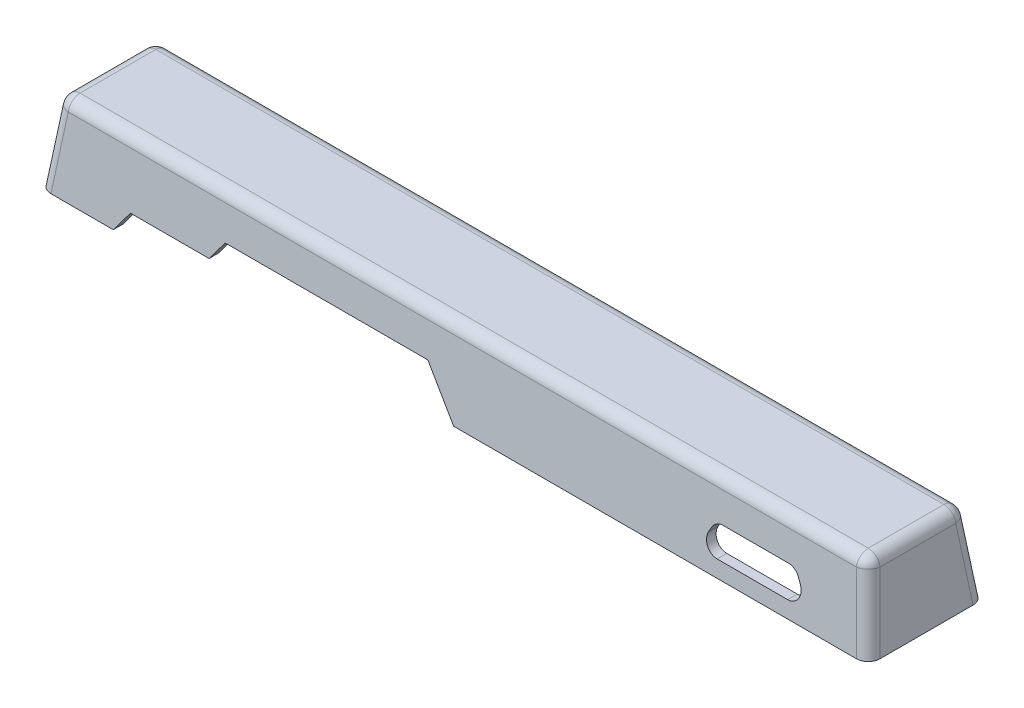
ISO-10303-21;
HEADER;
FILE_DESCRIPTION(('STEP AP214'),'2;1');
FILE_NAME('part.step','',(''),(''),'','','');
FILE_SCHEMA(('AUTOMOTIVE_DESIGN { 1 0 10303 214 1 1 1 1 }'));
ENDSEC;
DATA;
#1=APPLICATION_CONTEXT('core data for automotive mechanical design processes');
#2=APPLICATION_PROTOCOL_DEFINITION('international standard','automotive_design',2000,#1);
#3=PRODUCT_CONTEXT('',#1,'mechanical');
#4=PRODUCT('Part','Part','',(#3));
#5=PRODUCT_RELATED_PRODUCT_CATEGORY('part','',(#4));
#6=PRODUCT_DEFINITION_FORMATION('','',#4);
#7=PRODUCT_DEFINITION_CONTEXT('part definition',#1,'design');
#8=PRODUCT_DEFINITION('design','',#6,#7);
#9=PRODUCT_DEFINITION_SHAPE('','',#8);
#10=(LENGTH_UNIT() NAMED_UNIT(*) SI_UNIT(.MILLI.,.METRE.));
#11=(NAMED_UNIT(*) PLANE_ANGLE_UNIT() SI_UNIT($,.RADIAN.));
#12=(NAMED_UNIT(*) SI_UNIT($,.STERADIAN.) SOLID_ANGLE_UNIT());
#13=UNCERTAINTY_MEASURE_WITH_UNIT(LENGTH_MEASURE(1.E-05),#10,'distance_accuracy_value','');
#14=(GEOMETRIC_REPRESENTATION_CONTEXT(3) GLOBAL_UNCERTAINTY_ASSIGNED_CONTEXT((#13)) GLOBAL_UNIT_ASSIGNED_CONTEXT((#10,
#11,#12)) REPRESENTATION_CONTEXT('',''));
#15=CARTESIAN_POINT('',(0.,0.,0.));
#16=DIRECTION('',(0.,0.,1.));
#17=DIRECTION('',(1.,0.,0.));
#18=AXIS2_PLACEMENT_3D('',#15,#16,#17);
#19=CARTESIAN_POINT('',(-54.2283239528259,4.12974480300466,-12.7772446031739));
#20=DIRECTION('',(0.,1.,0.));
#21=DIRECTION('',(-1.,0.,0.));
#22=AXIS2_PLACEMENT_3D('',#19,#20,#21);
#23=PLANE('',#22);
#24=DIRECTION('',(0.,0.,1.));
#25=VECTOR('',#24,1.);
#26=CARTESIAN_POINT('',(-54.2283239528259,4.12974480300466,-12.7772446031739));
#27=LINE('',#26,#25);
#28=CARTESIAN_POINT('',(-54.2283239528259,4.12974480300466,-12.2273182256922));
#29=VERTEX_POINT('',#28);
#30=CARTESIAN_POINT('',(-54.2283239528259,4.12974480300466,-10.1186404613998));
#31=VERTEX_POINT('',#30);
#32=EDGE_CURVE('E526',#29,#31,#27,.T.);
#33=ORIENTED_EDGE('',*,*,#32,.T.);
#34=DIRECTION('',(1.,0.,0.));
#35=VECTOR('',#34,1.);
#36=CARTESIAN_POINT('',(-90.9204058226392,4.12974480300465,-10.1186404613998));
#37=LINE('',#36,#35);
#38=CARTESIAN_POINT('',(-71.4394913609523,4.12974480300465,-10.1186404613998));
#39=VERTEX_POINT('',#38);
#40=EDGE_CURVE('E390',#31,#39,#37,.F.);
#41=ORIENTED_EDGE('',*,*,#40,.T.);
#42=DIRECTION('',(0.,0.,1.));
#43=VECTOR('',#42,1.);
#44=CARTESIAN_POINT('',(-71.4394913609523,4.12974480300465,-12.7772446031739));
#45=LINE('',#44,#43);
#46=CARTESIAN_POINT('',(-71.4394913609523,4.12974480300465,-12.2273182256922));
#47=VERTEX_POINT('',#46);
#48=EDGE_CURVE('E522',#47,#39,#45,.T.);
#49=ORIENTED_EDGE('',*,*,#48,.F.);
#50=DIRECTION('',(1.,0.,0.));
#51=VECTOR('',#50,1.);
#52=CARTESIAN_POINT('',(-90.9204058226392,4.12974480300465,-12.2273182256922));
#53=LINE('',#52,#51);
#54=EDGE_CURVE('E580',#29,#47,#53,.F.);
#55=ORIENTED_EDGE('',*,*,#54,.F.);
#56=EDGE_LOOP('',(#33,#41,#49,#55));
#57=FACE_BOUND('',#56,.T.);
#58=ADVANCED_FACE('F33',(#57),#23,.F.);
#59=CARTESIAN_POINT('',(-51.2011413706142,8.33718611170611,-12.7772446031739));
#60=DIRECTION('',(-0.811733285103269,0.5840283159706,0.));
#61=DIRECTION('',(-0.5840283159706,-0.811733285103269,0.));
#62=AXIS2_PLACEMENT_3D('',#59,#60,#61);
#63=PLANE('',#62);
#64=DIRECTION('',(0.,0.,1.));
#65=VECTOR('',#64,1.);
#66=CARTESIAN_POINT('',(-51.2011413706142,8.33718611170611,-12.7772446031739));
#67=LINE('',#66,#65);
#68=CARTESIAN_POINT('',(-51.2011413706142,8.33718611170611,-11.7107093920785));
#69=VERTEX_POINT('',#68);
#70=CARTESIAN_POINT('',(-51.2011413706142,8.33718611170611,-9.60203162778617));
#71=VERTEX_POINT('',#70);
#72=EDGE_CURVE('E530',#69,#71,#67,.T.);
#73=ORIENTED_EDGE('',*,*,#72,.T.);
#74=DIRECTION('',(0.581148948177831,0.807731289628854,0.0991769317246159));
#75=VECTOR('',#74,1.);
#76=CARTESIAN_POINT('',(-68.8761230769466,-16.2290387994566,-12.6183847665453));
#77=LINE('',#76,#75);
#78=EDGE_CURVE('E463',#71,#31,#77,.F.);
#79=ORIENTED_EDGE('',*,*,#78,.T.);
#80=ORIENTED_EDGE('',*,*,#32,.F.);
#81=DIRECTION('',(0.581148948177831,0.807731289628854,0.0991769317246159));
#82=VECTOR('',#81,1.);
#83=CARTESIAN_POINT('',(-68.7545861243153,-16.0601161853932,-14.7063214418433));
#84=LINE('',#83,#82);
#85=EDGE_CURVE('E577',#69,#29,#84,.F.);
#86=ORIENTED_EDGE('',*,*,#85,.F.);
#87=EDGE_LOOP('',(#73,#79,#80,#86));
#88=FACE_BOUND('',#87,.T.);
#89=ADVANCED_FACE('F737',(#88),#63,.F.);
#90=CARTESIAN_POINT('',(-6.80539812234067,8.33718611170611,-12.7772446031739));
#91=DIRECTION('',(0.,1.,0.));
#92=DIRECTION('',(-1.,0.,0.));
#93=AXIS2_PLACEMENT_3D('',#90,#91,#92);
#94=PLANE('',#93);
#95=DIRECTION('',(0.,0.,1.));
#96=VECTOR('',#95,1.);
#97=CARTESIAN_POINT('',(-6.80539812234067,8.33718611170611,-12.7772446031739));
#98=LINE('',#97,#96);
#99=CARTESIAN_POINT('',(-6.80539812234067,8.33718611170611,-11.7107093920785));
#100=VERTEX_POINT('',#99);
#101=CARTESIAN_POINT('',(-6.80539812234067,8.33718611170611,-9.60203162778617));
#102=VERTEX_POINT('',#101);
#103=EDGE_CURVE('E534',#100,#102,#98,.T.);
#104=ORIENTED_EDGE('',*,*,#103,.T.);
#105=DIRECTION('',(1.,0.,0.));
#106=VECTOR('',#105,1.);
#107=CARTESIAN_POINT('',(-90.9204058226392,8.3371861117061,-9.60203162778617));
#108=LINE('',#107,#106);
#109=EDGE_CURVE('E466',#102,#71,#108,.F.);
#110=ORIENTED_EDGE('',*,*,#109,.T.);
#111=ORIENTED_EDGE('',*,*,#72,.F.);
#112=DIRECTION('',(1.,0.,0.));
#113=VECTOR('',#112,1.);
#114=CARTESIAN_POINT('',(-90.9204058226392,8.3371861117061,-11.7107093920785));
#115=LINE('',#114,#113);
#116=EDGE_CURVE('E574',#100,#69,#115,.F.);
#117=ORIENTED_EDGE('',*,*,#116,.F.);
#118=EDGE_LOOP('',(#104,#110,#111,#117));
#119=FACE_BOUND('',#118,.T.);
#120=ADVANCED_FACE('F743',(#119),#94,.F.);
#121=CARTESIAN_POINT('',(-71.4394913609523,4.12974480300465,-12.7772446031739));
#122=DIRECTION('',(-0.811733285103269,0.5840283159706,0.));
#123=DIRECTION('',(-0.5840283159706,-0.811733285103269,0.));
#124=AXIS2_PLACEMENT_3D('',#121,#122,#123);
#125=PLANE('',#124);
#126=ORIENTED_EDGE('',*,*,#48,.T.);
#127=DIRECTION('',(0.581148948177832,0.807731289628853,0.0991769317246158));
#128=VECTOR('',#127,1.);
#129=CARTESIAN_POINT('',(-80.2744923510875,-8.14990702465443,-11.6263921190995));
#130=LINE('',#129,#128);
#131=CARTESIAN_POINT('',(-74.6619053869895,-0.349046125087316,-10.6685668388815));
#132=VERTEX_POINT('',#131);
#133=EDGE_CURVE('E456',#39,#132,#130,.F.);
#134=ORIENTED_EDGE('',*,*,#133,.T.);
#135=DIRECTION('',(0.,0.,1.));
#136=VECTOR('',#135,1.);
#137=CARTESIAN_POINT('',(-74.6619053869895,-0.349046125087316,-12.7772446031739));
#138=LINE('',#137,#136);
#139=CARTESIAN_POINT('',(-74.6619053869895,-0.349046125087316,-12.7772446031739));
#140=VERTEX_POINT('',#139);
#141=EDGE_CURVE('E517',#140,#132,#138,.T.);
#142=ORIENTED_EDGE('',*,*,#141,.F.);
#143=DIRECTION('',(0.581148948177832,0.807731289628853,0.0991769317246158));
#144=VECTOR('',#143,1.);
#145=CARTESIAN_POINT('',(-80.1529553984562,-7.98098441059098,-13.7143287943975));
#146=LINE('',#145,#144);
#147=EDGE_CURVE('E546',#47,#140,#146,.F.);
#148=ORIENTED_EDGE('',*,*,#147,.F.);
#149=EDGE_LOOP('',(#126,#134,#142,#148));
#150=FACE_BOUND('',#149,.T.);
#151=ADVANCED_FACE('F765',(#150),#125,.F.);
#152=CARTESIAN_POINT('',(-0.0928432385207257,-0.349046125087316,-12.7772446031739));
#153=DIRECTION('',(0.791264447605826,0.611474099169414,0.));
#154=DIRECTION('',(-0.611474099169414,0.791264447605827,0.));
#155=AXIS2_PLACEMENT_3D('',#152,#153,#154);
#156=PLANE('',#155);
#157=DIRECTION('',(0.,0.,1.));
#158=VECTOR('',#157,1.);
#159=CARTESIAN_POINT('',(-0.0928432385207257,-0.349046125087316,-12.7772446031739));
#160=LINE('',#159,#158);
#161=CARTESIAN_POINT('',(-0.0928432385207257,-0.349046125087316,-12.7772446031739));
#162=VERTEX_POINT('',#161);
#163=CARTESIAN_POINT('',(-0.0928432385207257,-0.349046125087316,-10.6685668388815));
#164=VERTEX_POINT('',#163);
#165=EDGE_CURVE('E538',#162,#164,#160,.T.);
#166=ORIENTED_EDGE('',*,*,#165,.T.);
#167=DIRECTION('',(0.608608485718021,-0.787556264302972,-0.0966997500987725));
#168=VECTOR('',#167,1.);
#169=CARTESIAN_POINT('',(-33.6116614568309,43.025234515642,-5.3428748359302));
#170=LINE('',#169,#168);
#171=EDGE_CURVE('E437',#164,#102,#170,.F.);
#172=ORIENTED_EDGE('',*,*,#171,.T.);
#173=ORIENTED_EDGE('',*,*,#103,.F.);
#174=DIRECTION('',(0.608608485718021,-0.787556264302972,-0.0966997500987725));
#175=VECTOR('',#174,1.);
#176=CARTESIAN_POINT('',(-33.7357619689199,43.1858240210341,-7.43183468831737));
#177=LINE('',#176,#175);
#178=EDGE_CURVE('E520',#162,#100,#177,.F.);
#179=ORIENTED_EDGE('',*,*,#178,.F.);
#180=EDGE_LOOP('',(#166,#172,#173,#179));
#181=FACE_BOUND('',#180,.T.);
#182=ADVANCED_FACE('F759',(#181),#156,.F.);
#183=CARTESIAN_POINT('',(-90.9204058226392,-0.349046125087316,12.7861632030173));
#184=DIRECTION('',(0.,1.,0.));
#185=DIRECTION('',(0.,0.,1.));
#186=AXIS2_PLACEMENT_3D('',#183,#184,#185);
#187=PLANE('',#186);
#188=CARTESIAN_POINT('',(-88.2845586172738,-0.349046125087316,10.1503159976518));
#189=DIRECTION('',(0.,1.,0.));
#190=DIRECTION('',(-0.707106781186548,0.,0.707106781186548));
#191=AXIS2_PLACEMENT_3D('',#188,#189,#190);
#192=ELLIPSE('',#191,0.531069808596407,0.52324);
#193=CARTESIAN_POINT('',(-88.2923882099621,-0.349046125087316,10.6774854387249));
#194=VERTEX_POINT('',#193);
#195=CARTESIAN_POINT('',(-88.8117280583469,-0.349046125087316,10.1581455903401));
#196=VERTEX_POINT('',#195);
#197=EDGE_CURVE('E381',#194,#196,#192,.F.);
#198=ORIENTED_EDGE('',*,*,#197,.F.);
#199=DIRECTION('',(-1.,0.,0.));
#200=VECTOR('',#199,1.);
#201=CARTESIAN_POINT('',(-90.9204058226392,-0.349046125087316,10.6774854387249));
#202=LINE('',#201,#200);
#203=CARTESIAN_POINT('',(-74.6619053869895,-0.349046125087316,10.6774854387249));
#204=VERTEX_POINT('',#203);
#205=EDGE_CURVE('E476',#194,#204,#202,.F.);
#206=ORIENTED_EDGE('',*,*,#205,.T.);
#207=CARTESIAN_POINT('',(-74.6619053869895,-0.349046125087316,12.7861632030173));
#208=VERTEX_POINT('',#207);
#209=EDGE_CURVE('E521',#204,#208,#138,.T.);
#210=ORIENTED_EDGE('',*,*,#209,.T.);
#211=DIRECTION('',(1.,0.,0.));
#212=VECTOR('',#211,1.);
#213=CARTESIAN_POINT('',(-90.9204058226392,-0.349046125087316,12.7861632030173));
#214=LINE('',#213,#212);
#215=CARTESIAN_POINT('',(-88.3237065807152,-0.349046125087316,12.7861632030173));
#216=VERTEX_POINT('',#215);
#217=EDGE_CURVE('E565',#216,#208,#214,.T.);
#218=ORIENTED_EDGE('',*,*,#217,.F.);
#219=CARTESIAN_POINT('',(-88.2845586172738,-0.349046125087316,10.1503159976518));
#220=DIRECTION('',(0.,1.,0.));
#221=DIRECTION('',(-0.707106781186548,0.,0.707106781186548));
#222=AXIS2_PLACEMENT_3D('',#219,#220,#221);
#223=ELLIPSE('',#222,2.65534904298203,2.6162);
#224=CARTESIAN_POINT('',(-90.9204058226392,-0.349046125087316,10.1894639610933));
#225=VERTEX_POINT('',#224);
#226=EDGE_CURVE('E590',#216,#225,#223,.F.);
#227=ORIENTED_EDGE('',*,*,#226,.T.);
#228=DIRECTION('',(0.,0.,1.));
#229=VECTOR('',#228,1.);
#230=CARTESIAN_POINT('',(-90.9204058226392,-0.349046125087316,-12.7772446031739));
#231=LINE('',#230,#229);
#232=CARTESIAN_POINT('',(-90.9204058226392,-0.349046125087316,-10.1805453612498));
#233=VERTEX_POINT('',#232);
#234=EDGE_CURVE('E561',#233,#225,#231,.T.);
#235=ORIENTED_EDGE('',*,*,#234,.F.);
#236=CARTESIAN_POINT('',(-88.2845586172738,-0.349046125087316,-10.1413973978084));
#237=DIRECTION('',(0.,1.,0.));
#238=DIRECTION('',(-0.707106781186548,0.,-0.707106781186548));
#239=AXIS2_PLACEMENT_3D('',#236,#237,#238);
#240=ELLIPSE('',#239,2.65534904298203,2.6162);
#241=CARTESIAN_POINT('',(-88.3237065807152,-0.349046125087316,-12.7772446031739));
#242=VERTEX_POINT('',#241);
#243=EDGE_CURVE('E588',#233,#242,#240,.F.);
#244=ORIENTED_EDGE('',*,*,#243,.T.);
#245=DIRECTION('',(-1.,0.,0.));
#246=VECTOR('',#245,1.);
#247=CARTESIAN_POINT('',(-90.9204058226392,-0.349046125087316,-12.7772446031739));
#248=LINE('',#247,#246);
#249=EDGE_CURVE('E571',#140,#242,#248,.T.);
#250=ORIENTED_EDGE('',*,*,#249,.F.);
#251=ORIENTED_EDGE('',*,*,#141,.T.);
#252=DIRECTION('',(1.,0.,0.));
#253=VECTOR('',#252,1.);
#254=CARTESIAN_POINT('',(-90.9204058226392,-0.349046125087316,-10.6685668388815));
#255=LINE('',#254,#253);
#256=CARTESIAN_POINT('',(-88.2923882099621,-0.349046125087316,-10.6685668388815));
#257=VERTEX_POINT('',#256);
#258=EDGE_CURVE('E451',#132,#257,#255,.F.);
#259=ORIENTED_EDGE('',*,*,#258,.T.);
#260=CARTESIAN_POINT('',(-88.2845586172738,-0.349046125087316,-10.1413973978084));
#261=DIRECTION('',(0.,1.,0.));
#262=DIRECTION('',(-0.707106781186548,0.,-0.707106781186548));
#263=AXIS2_PLACEMENT_3D('',#260,#261,#262);
#264=ELLIPSE('',#263,0.531069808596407,0.52324);
#265=CARTESIAN_POINT('',(-88.8117280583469,-0.349046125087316,-10.1492269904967));
#266=VERTEX_POINT('',#265);
#267=EDGE_CURVE('E384',#266,#257,#264,.F.);
#268=ORIENTED_EDGE('',*,*,#267,.F.);
#269=DIRECTION('',(0.,0.,-1.));
#270=VECTOR('',#269,1.);
#271=CARTESIAN_POINT('',(-88.8117280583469,-0.349046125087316,-12.7772446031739));
#272=LINE('',#271,#270);
#273=EDGE_CURVE('E445',#266,#196,#272,.F.);
#274=ORIENTED_EDGE('',*,*,#273,.T.);
#275=EDGE_LOOP('',(#198,#206,#210,#218,#227,#235,#244,#250,#251,#259,#268,#274));
#276=FACE_BOUND('',#275,.T.);
#277=ADVANCED_FACE('F671',(#276),#187,.F.);
#278=CARTESIAN_POINT('',(-90.9204058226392,-0.349046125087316,-12.7772446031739));
#279=DIRECTION('',(-0.992546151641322,0.121869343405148,0.));
#280=DIRECTION('',(-0.121869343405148,-0.992546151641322,0.));
#281=AXIS2_PLACEMENT_3D('',#278,#279,#280);
#282=PLANE('',#281);
#283=DIRECTION('',(0.120974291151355,0.985256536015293,-0.120974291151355));
#284=VECTOR('',#283,1.);
#285=CARTESIAN_POINT('',(-90.5842931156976,2.38837219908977,9.85335125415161));
#286=LINE('',#285,#284);
#287=CARTESIAN_POINT('',(-89.0181298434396,15.1437484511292,8.28718798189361));
#288=VERTEX_POINT('',#287);
#289=EDGE_CURVE('E594',#225,#288,#286,.T.);
#290=ORIENTED_EDGE('',*,*,#289,.T.);
#291=DIRECTION('',(0.,0.,1.));
#292=VECTOR('',#291,1.);
#293=CARTESIAN_POINT('',(-89.0181298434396,15.1437484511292,-7.99618837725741));
#294=LINE('',#293,#292);
#295=CARTESIAN_POINT('',(-89.0181298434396,15.1437484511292,-8.27826938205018));
#296=VERTEX_POINT('',#295);
#297=EDGE_CURVE('E11',#288,#296,#294,.F.);
#298=ORIENTED_EDGE('',*,*,#297,.T.);
#299=DIRECTION('',(0.120974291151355,0.985256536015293,0.120974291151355));
#300=VECTOR('',#299,1.);
#301=CARTESIAN_POINT('',(-90.9584079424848,-0.65854855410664,-10.2185474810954));
#302=LINE('',#301,#300);
#303=EDGE_CURVE('E592',#296,#233,#302,.F.);
#304=ORIENTED_EDGE('',*,*,#303,.T.);
#305=ORIENTED_EDGE('',*,*,#234,.T.);
#306=EDGE_LOOP('',(#290,#298,#304,#305));
#307=FACE_BOUND('',#306,.T.);
#308=ADVANCED_FACE('F642',(#307),#282,.T.);
#309=CARTESIAN_POINT('',(-90.9204058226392,-0.349046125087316,12.7861632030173));
#310=DIRECTION('',(0.,0.121869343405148,0.992546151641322));
#311=DIRECTION('',(0.,-0.992546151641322,0.121869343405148));
#312=AXIS2_PLACEMENT_3D('',#309,#310,#311);
#313=PLANE('',#312);
#314=DIRECTION('',(-0.457956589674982,-0.882348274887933,0.10833874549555));
#315=VECTOR('',#314,1.);
#316=CARTESIAN_POINT('',(55.4361578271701,7.77582979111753,11.7885538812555));
#317=LINE('',#316,#315);
#318=CARTESIAN_POINT('',(55.4361578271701,7.77582979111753,11.7885538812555));
#319=VERTEX_POINT('',#318);
#320=CARTESIAN_POINT('',(54.8881235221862,6.71992813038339,11.9182023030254));
#321=VERTEX_POINT('',#320);
#322=EDGE_CURVE('E312',#319,#321,#317,.T.);
#323=ORIENTED_EDGE('',*,*,#322,.F.);
#324=CARTESIAN_POINT('',(57.7618930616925,6.5866542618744,11.9345662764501));
#325=DIRECTION('',(0.,0.121869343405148,0.992546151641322));
#326=DIRECTION('',(0.,0.992546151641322,-0.121869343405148));
#327=AXIS2_PLACEMENT_3D('',#324,#325,#326);
#328=CIRCLE('',#327,2.6162);
#329=CARTESIAN_POINT('',(57.7618930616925,9.18335350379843,11.6157317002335));
#330=VERTEX_POINT('',#329);
#331=EDGE_CURVE('E48',#330,#319,#328,.T.);
#332=ORIENTED_EDGE('',*,*,#331,.F.);
#333=DIRECTION('',(-1.,0.,0.));
#334=VECTOR('',#333,1.);
#335=CARTESIAN_POINT('',(57.7618930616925,9.18335350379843,11.6157317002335));
#336=LINE('',#335,#334);
#337=CARTESIAN_POINT('',(72.1246187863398,9.18335350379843,11.6157317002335));
#338=VERTEX_POINT('',#337);
#339=EDGE_CURVE('E299',#338,#330,#336,.T.);
#340=ORIENTED_EDGE('',*,*,#339,.F.);
#341=CARTESIAN_POINT('',(72.1246187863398,6.5866542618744,11.9345662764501));
#342=DIRECTION('',(0.,0.121869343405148,0.992546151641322));
#343=DIRECTION('',(0.,0.992546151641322,-0.121869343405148));
#344=AXIS2_PLACEMENT_3D('',#341,#342,#343);
#345=CIRCLE('',#344,2.6162);
#346=CARTESIAN_POINT('',(74.4503540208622,7.77582979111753,11.7885538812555));
#347=VERTEX_POINT('',#346);
#348=EDGE_CURVE('E307',#347,#338,#345,.T.);
#349=ORIENTED_EDGE('',*,*,#348,.F.);
#350=DIRECTION('',(-0.457956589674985,0.882348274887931,-0.108338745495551));
#351=VECTOR('',#350,1.);
#352=CARTESIAN_POINT('',(74.4503540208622,7.77582979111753,11.7885538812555));
#353=LINE('',#352,#351);
#354=CARTESIAN_POINT('',(74.9983883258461,6.71992813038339,11.9182023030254));
#355=VERTEX_POINT('',#354);
#356=EDGE_CURVE('E1252',#355,#347,#353,.T.);
#357=ORIENTED_EDGE('',*,*,#356,.F.);
#358=CARTESIAN_POINT('',(72.6726530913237,5.53075260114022,12.06421469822));
#359=DIRECTION('',(0.,0.121869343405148,0.992546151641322));
#360=DIRECTION('',(0.,0.992546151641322,-0.121869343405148));
#361=AXIS2_PLACEMENT_3D('',#358,#359,#360);
#362=CIRCLE('',#361,2.6162);
#363=CARTESIAN_POINT('',(72.6726530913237,2.93405335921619,12.3830492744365));
#364=VERTEX_POINT('',#363);
#365=EDGE_CURVE('E1248',#364,#355,#362,.T.);
#366=ORIENTED_EDGE('',*,*,#365,.F.);
#367=DIRECTION('',(1.,0.,0.));
#368=VECTOR('',#367,1.);
#369=CARTESIAN_POINT('',(72.6726530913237,2.93405335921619,12.3830492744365));
#370=LINE('',#369,#368);
#371=CARTESIAN_POINT('',(57.2138587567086,2.93405335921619,12.3830492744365));
#372=VERTEX_POINT('',#371);
#373=EDGE_CURVE('E1253',#372,#364,#370,.T.);
#374=ORIENTED_EDGE('',*,*,#373,.F.);
#375=CARTESIAN_POINT('',(57.2138587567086,5.53075260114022,12.06421469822));
#376=DIRECTION('',(0.,0.121869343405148,0.992546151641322));
#377=DIRECTION('',(0.,-0.992546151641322,0.121869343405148));
#378=AXIS2_PLACEMENT_3D('',#375,#376,#377);
#379=CIRCLE('',#378,2.6162);
#380=EDGE_CURVE('E314',#321,#372,#379,.T.);
#381=ORIENTED_EDGE('',*,*,#380,.F.);
#382=EDGE_LOOP('',(#323,#332,#340,#349,#357,#366,#374,#381));
#383=FACE_BOUND('',#382,.T.);
#384=DIRECTION('',(-0.120974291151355,0.985256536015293,-0.120974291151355));
#385=VECTOR('',#384,1.);
#386=CARTESIAN_POINT('',(85.5175395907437,20.9930549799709,10.1656826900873));
#387=LINE('',#386,#385);
#388=CARTESIAN_POINT('',(88.1380201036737,-0.349046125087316,12.7861632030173));
#389=VERTEX_POINT('',#388);
#390=CARTESIAN_POINT('',(86.235744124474,15.1437484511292,10.8838872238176));
#391=VERTEX_POINT('',#390);
#392=EDGE_CURVE('E583',#389,#391,#387,.T.);
#393=ORIENTED_EDGE('',*,*,#392,.T.);
#394=DIRECTION('',(1.,0.,0.));
#395=VECTOR('',#394,1.);
#396=CARTESIAN_POINT('',(-86.1393495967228,15.1437484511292,10.8838872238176));
#397=LINE('',#396,#395);
#398=CARTESIAN_POINT('',(-86.4214306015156,15.1437484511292,10.8838872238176));
#399=VERTEX_POINT('',#398);
#400=EDGE_CURVE('E631',#391,#399,#397,.F.);
#401=ORIENTED_EDGE('',*,*,#400,.T.);
#402=DIRECTION('',(0.120974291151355,0.985256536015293,-0.120974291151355));
#403=VECTOR('',#402,1.);
#404=CARTESIAN_POINT('',(-88.3617087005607,-0.658548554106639,12.8241653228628));
#405=LINE('',#404,#403);
#406=EDGE_CURVE('E586',#399,#216,#405,.F.);
#407=ORIENTED_EDGE('',*,*,#406,.T.);
#408=ORIENTED_EDGE('',*,*,#217,.T.);
#409=DIRECTION('',(-0.581148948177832,-0.807731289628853,0.0991769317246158));
#410=VECTOR('',#409,1.);
#411=CARTESIAN_POINT('',(-80.1529553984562,-7.98098441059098,13.7232473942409));
#412=LINE('',#411,#410);
#413=CARTESIAN_POINT('',(-71.4394913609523,4.12974480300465,12.2362368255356));
#414=VERTEX_POINT('',#413);
#415=EDGE_CURVE('E549',#208,#414,#412,.F.);
#416=ORIENTED_EDGE('',*,*,#415,.T.);
#417=DIRECTION('',(-1.,0.,0.));
#418=VECTOR('',#417,1.);
#419=CARTESIAN_POINT('',(-90.9204058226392,4.12974480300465,12.2362368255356));
#420=LINE('',#419,#418);
#421=CARTESIAN_POINT('',(-54.2283239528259,4.12974480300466,12.2362368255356));
#422=VERTEX_POINT('',#421);
#423=EDGE_CURVE('E558',#414,#422,#420,.F.);
#424=ORIENTED_EDGE('',*,*,#423,.T.);
#425=DIRECTION('',(-0.581148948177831,-0.807731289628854,0.0991769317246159));
#426=VECTOR('',#425,1.);
#427=CARTESIAN_POINT('',(-68.7545861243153,-16.0601161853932,14.7152400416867));
#428=LINE('',#427,#426);
#429=CARTESIAN_POINT('',(-51.2011413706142,8.33718611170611,11.7196279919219));
#430=VERTEX_POINT('',#429);
#431=EDGE_CURVE('E555',#422,#430,#428,.F.);
#432=ORIENTED_EDGE('',*,*,#431,.T.);
#433=DIRECTION('',(-1.,0.,0.));
#434=VECTOR('',#433,1.);
#435=CARTESIAN_POINT('',(-90.9204058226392,8.3371861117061,11.7196279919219));
#436=LINE('',#435,#434);
#437=CARTESIAN_POINT('',(-6.80539812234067,8.33718611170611,11.7196279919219));
#438=VERTEX_POINT('',#437);
#439=EDGE_CURVE('E552',#430,#438,#436,.F.);
#440=ORIENTED_EDGE('',*,*,#439,.T.);
#441=DIRECTION('',(-0.608608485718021,0.787556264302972,-0.0966997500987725));
#442=VECTOR('',#441,1.);
#443=CARTESIAN_POINT('',(-33.7357619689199,43.1858240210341,7.44075328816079));
#444=LINE('',#443,#442);
#445=CARTESIAN_POINT('',(-0.0928432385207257,-0.349046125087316,12.7861632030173));
#446=VERTEX_POINT('',#445);
#447=EDGE_CURVE('E543',#438,#446,#444,.F.);
#448=ORIENTED_EDGE('',*,*,#447,.T.);
#449=EDGE_CURVE('E564',#446,#389,#214,.T.);
#450=ORIENTED_EDGE('',*,*,#449,.T.);
#451=EDGE_LOOP('',(#393,#401,#407,#408,#416,#424,#432,#440,#448,#450));
#452=FACE_BOUND('',#451,.T.);
#453=ADVANCED_FACE('F35',(#383,#452),#313,.T.);
#454=CARTESIAN_POINT('',(90.7347193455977,-0.349046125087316,-12.7772446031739));
#455=DIRECTION('',(0.992546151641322,0.121869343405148,0.));
#456=DIRECTION('',(-0.121869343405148,0.992546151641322,0.));
#457=AXIS2_PLACEMENT_3D('',#454,#455,#456);
#458=PLANE('',#457);
#459=DIRECTION('',(-0.120974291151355,0.985256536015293,0.120974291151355));
#460=VECTOR('',#459,1.);
#461=CARTESIAN_POINT('',(90.7727214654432,-0.65854855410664,-10.2185474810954));
#462=LINE('',#461,#460);
#463=CARTESIAN_POINT('',(90.7347193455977,-0.349046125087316,-10.1805453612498));
#464=VERTEX_POINT('',#463);
#465=CARTESIAN_POINT('',(88.8324433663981,15.1437484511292,-8.27826938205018));
#466=VERTEX_POINT('',#465);
#467=EDGE_CURVE('E608',#464,#466,#462,.T.);
#468=ORIENTED_EDGE('',*,*,#467,.T.);
#469=DIRECTION('',(0.,0.,-1.));
#470=VECTOR('',#469,1.);
#471=CARTESIAN_POINT('',(88.8324433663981,15.1437484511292,8.00510697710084));
#472=LINE('',#471,#470);
#473=CARTESIAN_POINT('',(88.832443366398,15.1437484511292,8.2871879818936));
#474=VERTEX_POINT('',#473);
#475=EDGE_CURVE('E627',#466,#474,#472,.F.);
#476=ORIENTED_EDGE('',*,*,#475,.T.);
#477=DIRECTION('',(-0.120974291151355,0.985256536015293,-0.120974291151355));
#478=VECTOR('',#477,1.);
#479=CARTESIAN_POINT('',(90.398606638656,2.38837219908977,9.85335125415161));
#480=LINE('',#479,#478);
#481=CARTESIAN_POINT('',(90.7347193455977,-0.349046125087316,10.1894639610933));
#482=VERTEX_POINT('',#481);
#483=EDGE_CURVE('E606',#474,#482,#480,.F.);
#484=ORIENTED_EDGE('',*,*,#483,.T.);
#485=DIRECTION('',(0.,0.,-1.));
#486=VECTOR('',#485,1.);
#487=CARTESIAN_POINT('',(90.7347193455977,-0.349046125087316,-12.7772446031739));
#488=LINE('',#487,#486);
#489=EDGE_CURVE('E568',#482,#464,#488,.T.);
#490=ORIENTED_EDGE('',*,*,#489,.T.);
#491=EDGE_LOOP('',(#468,#476,#484,#490));
#492=FACE_BOUND('',#491,.T.);
#493=ADVANCED_FACE('F729',(#492),#458,.T.);
#494=CARTESIAN_POINT('',(-90.9204058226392,-0.349046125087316,-12.7772446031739));
#495=DIRECTION('',(0.,0.121869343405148,-0.992546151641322));
#496=DIRECTION('',(0.,0.992546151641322,0.121869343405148));
#497=AXIS2_PLACEMENT_3D('',#494,#495,#496);
#498=PLANE('',#497);
#499=DIRECTION('',(0.120974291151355,0.985256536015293,0.120974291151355));
#500=VECTOR('',#499,1.);
#501=CARTESIAN_POINT('',(-88.3617087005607,-0.658548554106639,-12.8152467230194));
#502=LINE('',#501,#500);
#503=CARTESIAN_POINT('',(-86.4214306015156,15.1437484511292,-10.8749686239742));
#504=VERTEX_POINT('',#503);
#505=EDGE_CURVE('E599',#242,#504,#502,.T.);
#506=ORIENTED_EDGE('',*,*,#505,.T.);
#507=DIRECTION('',(-1.,0.,0.));
#508=VECTOR('',#507,1.);
#509=CARTESIAN_POINT('',(85.9536631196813,15.1437484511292,-10.8749686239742));
#510=LINE('',#509,#508);
#511=CARTESIAN_POINT('',(86.235744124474,15.1437484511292,-10.8749686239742));
#512=VERTEX_POINT('',#511);
#513=EDGE_CURVE('E623',#504,#512,#510,.F.);
#514=ORIENTED_EDGE('',*,*,#513,.T.);
#515=DIRECTION('',(-0.120974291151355,0.985256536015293,0.120974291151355));
#516=VECTOR('',#515,1.);
#517=CARTESIAN_POINT('',(85.5175395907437,20.9930549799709,-10.1567640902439));
#518=LINE('',#517,#516);
#519=CARTESIAN_POINT('',(88.1380201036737,-0.349046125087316,-12.7772446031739));
#520=VERTEX_POINT('',#519);
#521=EDGE_CURVE('E597',#512,#520,#518,.F.);
#522=ORIENTED_EDGE('',*,*,#521,.T.);
#523=EDGE_CURVE('E572',#520,#162,#248,.T.);
#524=ORIENTED_EDGE('',*,*,#523,.T.);
#525=ORIENTED_EDGE('',*,*,#178,.T.);
#526=ORIENTED_EDGE('',*,*,#116,.T.);
#527=ORIENTED_EDGE('',*,*,#85,.T.);
#528=ORIENTED_EDGE('',*,*,#54,.T.);
#529=ORIENTED_EDGE('',*,*,#147,.T.);
#530=ORIENTED_EDGE('',*,*,#249,.T.);
#531=EDGE_LOOP('',(#506,#514,#522,#524,#525,#526,#527,#528,#529,#530));
#532=FACE_BOUND('',#531,.T.);
#533=ADVANCED_FACE('F667',(#532),#498,.T.);
#534=CARTESIAN_POINT('',(-90.9204058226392,17.4411138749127,12.7861632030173));
#535=DIRECTION('',(0.,1.,0.));
#536=DIRECTION('',(0.,0.,1.));
#537=AXIS2_PLACEMENT_3D('',#534,#535,#536);
#538=PLANE('',#537);
#539=DIRECTION('',(0.,0.,1.));
#540=VECTOR('',#539,1.);
#541=CARTESIAN_POINT('',(86.2357441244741,17.4411138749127,-7.99618837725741));
#542=LINE('',#541,#540);
#543=CARTESIAN_POINT('',(86.235744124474,17.4411138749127,8.2871879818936));
#544=VERTEX_POINT('',#543);
#545=CARTESIAN_POINT('',(86.2357441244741,17.4411138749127,-8.27826938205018));
#546=VERTEX_POINT('',#545);
#547=EDGE_CURVE('E618',#544,#546,#542,.F.);
#548=ORIENTED_EDGE('',*,*,#547,.T.);
#549=DIRECTION('',(1.,0.,0.));
#550=VECTOR('',#549,1.);
#551=CARTESIAN_POINT('',(-86.1393495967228,17.4411138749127,-8.27826938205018));
#552=LINE('',#551,#550);
#553=CARTESIAN_POINT('',(-86.4214306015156,17.4411138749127,-8.27826938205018));
#554=VERTEX_POINT('',#553);
#555=EDGE_CURVE('E620',#546,#554,#552,.F.);
#556=ORIENTED_EDGE('',*,*,#555,.T.);
#557=DIRECTION('',(0.,0.,-1.));
#558=VECTOR('',#557,1.);
#559=CARTESIAN_POINT('',(-86.4214306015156,17.4411138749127,8.00510697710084));
#560=LINE('',#559,#558);
#561=CARTESIAN_POINT('',(-86.4214306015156,17.4411138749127,8.2871879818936));
#562=VERTEX_POINT('',#561);
#563=EDGE_CURVE('E614',#554,#562,#560,.F.);
#564=ORIENTED_EDGE('',*,*,#563,.T.);
#565=DIRECTION('',(-1.,0.,0.));
#566=VECTOR('',#565,1.);
#567=CARTESIAN_POINT('',(85.9536631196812,17.4411138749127,8.2871879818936));
#568=LINE('',#567,#566);
#569=EDGE_CURVE('E616',#562,#544,#568,.F.);
#570=ORIENTED_EDGE('',*,*,#569,.T.);
#571=EDGE_LOOP('',(#548,#556,#564,#570));
#572=FACE_BOUND('',#571,.T.);
#573=ADVANCED_FACE('F716',(#572),#538,.T.);
#574=CARTESIAN_POINT('',(88.0988721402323,-0.349046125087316,-10.1413973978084));
#575=DIRECTION('',(0.,1.,0.));
#576=DIRECTION('',(0.707106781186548,0.,-0.707106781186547));
#577=AXIS2_PLACEMENT_3D('',#574,#575,#576);
#578=ELLIPSE('',#577,0.531069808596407,0.52324);
#579=CARTESIAN_POINT('',(88.1067017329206,-0.349046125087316,-10.6685668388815));
#580=VERTEX_POINT('',#579);
#581=CARTESIAN_POINT('',(88.6260415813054,-0.349046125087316,-10.1492269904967));
#582=VERTEX_POINT('',#581);
#583=EDGE_CURVE('E396',#580,#582,#578,.F.);
#584=ORIENTED_EDGE('',*,*,#583,.F.);
#585=DIRECTION('',(1.,0.,0.));
#586=VECTOR('',#585,1.);
#587=CARTESIAN_POINT('',(-90.9204058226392,-0.349046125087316,-10.6685668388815));
#588=LINE('',#587,#586);
#589=EDGE_CURVE('E454',#580,#164,#588,.F.);
#590=ORIENTED_EDGE('',*,*,#589,.T.);
#591=ORIENTED_EDGE('',*,*,#165,.F.);
#592=ORIENTED_EDGE('',*,*,#523,.F.);
#593=CARTESIAN_POINT('',(88.0988721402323,-0.349046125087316,-10.1413973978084));
#594=DIRECTION('',(0.,1.,0.));
#595=DIRECTION('',(0.707106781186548,0.,-0.707106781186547));
#596=AXIS2_PLACEMENT_3D('',#593,#594,#595);
#597=ELLIPSE('',#596,2.65534904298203,2.6162);
#598=EDGE_CURVE('E604',#520,#464,#597,.F.);
#599=ORIENTED_EDGE('',*,*,#598,.T.);
#600=ORIENTED_EDGE('',*,*,#489,.F.);
#601=CARTESIAN_POINT('',(88.0988721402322,-0.349046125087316,10.1503159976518));
#602=DIRECTION('',(0.,1.,0.));
#603=DIRECTION('',(0.707106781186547,0.,0.707106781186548));
#604=AXIS2_PLACEMENT_3D('',#601,#602,#603);
#605=ELLIPSE('',#604,2.65534904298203,2.6162);
#606=EDGE_CURVE('E602',#482,#389,#605,.F.);
#607=ORIENTED_EDGE('',*,*,#606,.T.);
#608=ORIENTED_EDGE('',*,*,#449,.F.);
#609=CARTESIAN_POINT('',(-0.0928432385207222,-0.349046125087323,10.6774854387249));
#610=VERTEX_POINT('',#609);
#611=EDGE_CURVE('E516',#610,#446,#160,.T.);
#612=ORIENTED_EDGE('',*,*,#611,.F.);
#613=DIRECTION('',(-1.,0.,0.));
#614=VECTOR('',#613,1.);
#615=CARTESIAN_POINT('',(-90.9204058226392,-0.349046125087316,10.6774854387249));
#616=LINE('',#615,#614);
#617=CARTESIAN_POINT('',(88.1067017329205,-0.349046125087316,10.6774854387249));
#618=VERTEX_POINT('',#617);
#619=EDGE_CURVE('E448',#610,#618,#616,.F.);
#620=ORIENTED_EDGE('',*,*,#619,.T.);
#621=CARTESIAN_POINT('',(88.0988721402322,-0.349046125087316,10.1503159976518));
#622=DIRECTION('',(0.,1.,0.));
#623=DIRECTION('',(0.707106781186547,0.,0.707106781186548));
#624=AXIS2_PLACEMENT_3D('',#621,#622,#623);
#625=ELLIPSE('',#624,0.531069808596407,0.52324);
#626=CARTESIAN_POINT('',(88.6260415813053,-0.349046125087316,10.1581455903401));
#627=VERTEX_POINT('',#626);
#628=EDGE_CURVE('E410',#627,#618,#625,.F.);
#629=ORIENTED_EDGE('',*,*,#628,.F.);
#630=DIRECTION('',(0.,0.,1.));
#631=VECTOR('',#630,1.);
#632=CARTESIAN_POINT('',(88.6260415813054,-0.349046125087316,-12.7772446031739));
#633=LINE('',#632,#631);
#634=EDGE_CURVE('E455',#627,#582,#633,.F.);
#635=ORIENTED_EDGE('',*,*,#634,.T.);
#636=EDGE_LOOP('',(#584,#590,#591,#592,#599,#600,#607,#608,#612,#620,#629,#635));
#637=FACE_BOUND('',#636,.T.);
#638=ADVANCED_FACE('F699',(#637),#187,.F.);
#639=CARTESIAN_POINT('',(-71.4394913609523,4.12974480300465,10.1275590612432));
#640=VERTEX_POINT('',#639);
#641=EDGE_CURVE('E525',#640,#414,#45,.T.);
#642=ORIENTED_EDGE('',*,*,#641,.F.);
#643=DIRECTION('',(-1.,0.,0.));
#644=VECTOR('',#643,1.);
#645=CARTESIAN_POINT('',(-90.9204058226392,4.12974480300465,10.1275590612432));
#646=LINE('',#645,#644);
#647=CARTESIAN_POINT('',(-54.2283239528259,4.12974480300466,10.1275590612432));
#648=VERTEX_POINT('',#647);
#649=EDGE_CURVE('E449',#640,#648,#646,.F.);
#650=ORIENTED_EDGE('',*,*,#649,.T.);
#651=EDGE_CURVE('E529',#648,#422,#27,.T.);
#652=ORIENTED_EDGE('',*,*,#651,.T.);
#653=ORIENTED_EDGE('',*,*,#423,.F.);
#654=EDGE_LOOP('',(#642,#650,#652,#653));
#655=FACE_BOUND('',#654,.T.);
#656=ADVANCED_FACE('F680',(#655),#23,.F.);
#657=ORIENTED_EDGE('',*,*,#651,.F.);
#658=DIRECTION('',(-0.581148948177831,-0.807731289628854,0.0991769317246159));
#659=VECTOR('',#658,1.);
#660=CARTESIAN_POINT('',(-68.8761230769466,-16.2290387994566,12.6273033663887));
#661=LINE('',#660,#659);
#662=CARTESIAN_POINT('',(-51.2011413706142,8.33718611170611,9.61095022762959));
#663=VERTEX_POINT('',#662);
#664=EDGE_CURVE('E485',#648,#663,#661,.F.);
#665=ORIENTED_EDGE('',*,*,#664,.T.);
#666=EDGE_CURVE('E533',#663,#430,#67,.T.);
#667=ORIENTED_EDGE('',*,*,#666,.T.);
#668=ORIENTED_EDGE('',*,*,#431,.F.);
#669=EDGE_LOOP('',(#657,#665,#667,#668));
#670=FACE_BOUND('',#669,.T.);
#671=ADVANCED_FACE('F685',(#670),#63,.F.);
#672=ORIENTED_EDGE('',*,*,#666,.F.);
#673=DIRECTION('',(-1.,0.,0.));
#674=VECTOR('',#673,1.);
#675=CARTESIAN_POINT('',(-90.9204058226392,8.3371861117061,9.6109502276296));
#676=LINE('',#675,#674);
#677=CARTESIAN_POINT('',(-6.80539812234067,8.33718611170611,9.61095022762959));
#678=VERTEX_POINT('',#677);
#679=EDGE_CURVE('E482',#663,#678,#676,.F.);
#680=ORIENTED_EDGE('',*,*,#679,.T.);
#681=EDGE_CURVE('E537',#678,#438,#98,.T.);
#682=ORIENTED_EDGE('',*,*,#681,.T.);
#683=ORIENTED_EDGE('',*,*,#439,.F.);
#684=EDGE_LOOP('',(#672,#680,#682,#683));
#685=FACE_BOUND('',#684,.T.);
#686=ADVANCED_FACE('F688',(#685),#94,.F.);
#687=ORIENTED_EDGE('',*,*,#209,.F.);
#688=DIRECTION('',(-0.581148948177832,-0.807731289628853,0.0991769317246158));
#689=VECTOR('',#688,1.);
#690=CARTESIAN_POINT('',(-80.2744923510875,-8.14990702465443,11.6353107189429));
#691=LINE('',#690,#689);
#692=EDGE_CURVE('E459',#204,#640,#691,.F.);
#693=ORIENTED_EDGE('',*,*,#692,.T.);
#694=ORIENTED_EDGE('',*,*,#641,.T.);
#695=ORIENTED_EDGE('',*,*,#415,.F.);
#696=EDGE_LOOP('',(#687,#693,#694,#695));
#697=FACE_BOUND('',#696,.T.);
#698=ADVANCED_FACE('F676',(#697),#125,.F.);
#699=ORIENTED_EDGE('',*,*,#681,.F.);
#700=DIRECTION('',(-0.608608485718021,0.787556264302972,-0.0966997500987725));
#701=VECTOR('',#700,1.);
#702=CARTESIAN_POINT('',(-33.6116614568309,43.025234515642,5.35179343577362));
#703=LINE('',#702,#701);
#704=EDGE_CURVE('E460',#678,#610,#703,.F.);
#705=ORIENTED_EDGE('',*,*,#704,.T.);
#706=ORIENTED_EDGE('',*,*,#611,.T.);
#707=ORIENTED_EDGE('',*,*,#447,.F.);
#708=EDGE_LOOP('',(#699,#705,#706,#707));
#709=FACE_BOUND('',#708,.T.);
#710=ADVANCED_FACE('F692',(#709),#156,.F.);
#711=CARTESIAN_POINT('',(-88.3617087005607,-0.977383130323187,10.2274660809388));
#712=DIRECTION('',(-0.120974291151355,-0.985256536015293,0.120974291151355));
#713=DIRECTION('',(0.,-0.121869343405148,-0.992546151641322));
#714=AXIS2_PLACEMENT_3D('',#711,#712,#713);
#715=CYLINDRICAL_SURFACE('',#714,2.6162);
#716=ORIENTED_EDGE('',*,*,#406,.F.);
#717=CARTESIAN_POINT('',(-86.4214306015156,14.8249138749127,8.2871879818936));
#718=DIRECTION('',(-0.120974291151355,-0.985256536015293,0.120974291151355));
#719=DIRECTION('',(0.,-0.121869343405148,-0.992546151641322));
#720=AXIS2_PLACEMENT_3D('',#717,#718,#719);
#721=CIRCLE('',#720,2.6162);
#722=EDGE_CURVE('E41',#399,#288,#721,.T.);
#723=ORIENTED_EDGE('',*,*,#722,.T.);
#724=ORIENTED_EDGE('',*,*,#289,.F.);
#725=ORIENTED_EDGE('',*,*,#226,.F.);
#726=EDGE_LOOP('',(#716,#723,#724,#725));
#727=FACE_BOUND('',#726,.T.);
#728=ADVANCED_FACE('F636',(#727),#715,.T.);
#729=CARTESIAN_POINT('',(-88.3617087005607,-0.977383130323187,-10.2185474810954));
#730=DIRECTION('',(-0.120974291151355,-0.985256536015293,-0.120974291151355));
#731=DIRECTION('',(0.,0.121869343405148,-0.992546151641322));
#732=AXIS2_PLACEMENT_3D('',#729,#730,#731);
#733=CYLINDRICAL_SURFACE('',#732,2.6162);
#734=ORIENTED_EDGE('',*,*,#303,.F.);
#735=CARTESIAN_POINT('',(-86.4214306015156,14.8249138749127,-8.27826938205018));
#736=DIRECTION('',(-0.120974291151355,-0.985256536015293,-0.120974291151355));
#737=DIRECTION('',(0.,0.121869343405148,-0.992546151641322));
#738=AXIS2_PLACEMENT_3D('',#735,#736,#737);
#739=CIRCLE('',#738,2.6162);
#740=EDGE_CURVE('E611',#296,#504,#739,.T.);
#741=ORIENTED_EDGE('',*,*,#740,.T.);
#742=ORIENTED_EDGE('',*,*,#505,.F.);
#743=ORIENTED_EDGE('',*,*,#243,.F.);
#744=EDGE_LOOP('',(#734,#741,#742,#743));
#745=FACE_BOUND('',#744,.T.);
#746=ADVANCED_FACE('F664',(#745),#733,.T.);
#747=CARTESIAN_POINT('',(85.5175395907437,20.6742204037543,-7.56006484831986));
#748=DIRECTION('',(0.120974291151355,-0.985256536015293,-0.120974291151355));
#749=DIRECTION('',(0.992546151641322,0.121869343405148,0.));
#750=AXIS2_PLACEMENT_3D('',#747,#748,#749);
#751=CYLINDRICAL_SURFACE('',#750,2.6162);
#752=ORIENTED_EDGE('',*,*,#521,.F.);
#753=CARTESIAN_POINT('',(86.235744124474,14.8249138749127,-8.27826938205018));
#754=DIRECTION('',(0.120974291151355,-0.985256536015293,-0.120974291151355));
#755=DIRECTION('',(0.992546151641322,0.121869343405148,0.));
#756=AXIS2_PLACEMENT_3D('',#753,#754,#755);
#757=CIRCLE('',#756,2.6162);
#758=EDGE_CURVE('E625',#512,#466,#757,.T.);
#759=ORIENTED_EDGE('',*,*,#758,.T.);
#760=ORIENTED_EDGE('',*,*,#467,.F.);
#761=ORIENTED_EDGE('',*,*,#598,.F.);
#762=EDGE_LOOP('',(#752,#759,#760,#761));
#763=FACE_BOUND('',#762,.T.);
#764=ADVANCED_FACE('F726',(#763),#751,.T.);
#765=CARTESIAN_POINT('',(87.801907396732,2.06953762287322,9.85335125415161));
#766=DIRECTION('',(0.120974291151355,-0.985256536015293,0.120974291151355));
#767=DIRECTION('',(0.,-0.121869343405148,-0.992546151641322));
#768=AXIS2_PLACEMENT_3D('',#765,#766,#767);
#769=CYLINDRICAL_SURFACE('',#768,2.6162);
#770=ORIENTED_EDGE('',*,*,#483,.F.);
#771=CARTESIAN_POINT('',(86.235744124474,14.8249138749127,8.2871879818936));
#772=DIRECTION('',(0.120974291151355,-0.985256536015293,0.120974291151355));
#773=DIRECTION('',(0.,-0.121869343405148,-0.992546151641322));
#774=AXIS2_PLACEMENT_3D('',#771,#772,#773);
#775=CIRCLE('',#774,2.6162);
#776=EDGE_CURVE('E629',#474,#391,#775,.T.);
#777=ORIENTED_EDGE('',*,*,#776,.T.);
#778=ORIENTED_EDGE('',*,*,#392,.F.);
#779=ORIENTED_EDGE('',*,*,#606,.F.);
#780=EDGE_LOOP('',(#770,#777,#778,#779));
#781=FACE_BOUND('',#780,.T.);
#782=ADVANCED_FACE('F704',(#781),#769,.T.);
#783=CARTESIAN_POINT('',(86.235744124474,14.8249138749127,8.2871879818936));
#784=DIRECTION('',(0.,0.,1.));
#785=DIRECTION('',(1.,0.,0.));
#786=AXIS2_PLACEMENT_3D('',#783,#784,#785);
#787=SPHERICAL_SURFACE('',#786,2.6162);
#788=CARTESIAN_POINT('',(86.235744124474,14.8249138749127,8.2871879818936));
#789=DIRECTION('',(-1.,0.,0.));
#790=DIRECTION('',(0.,0.,1.));
#791=AXIS2_PLACEMENT_3D('',#788,#789,#790);
#792=CIRCLE('',#791,2.6162);
#793=EDGE_CURVE('E510',#391,#544,#792,.T.);
#794=ORIENTED_EDGE('',*,*,#793,.F.);
#795=ORIENTED_EDGE('',*,*,#776,.F.);
#796=CARTESIAN_POINT('',(86.235744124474,14.8249138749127,8.2871879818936));
#797=DIRECTION('',(0.,0.,-1.));
#798=DIRECTION('',(-1.,0.,0.));
#799=AXIS2_PLACEMENT_3D('',#796,#797,#798);
#800=CIRCLE('',#799,2.6162);
#801=EDGE_CURVE('E513',#544,#474,#800,.T.);
#802=ORIENTED_EDGE('',*,*,#801,.F.);
#803=EDGE_LOOP('',(#794,#795,#802));
#804=FACE_BOUND('',#803,.T.);
#805=ADVANCED_FACE('F710',(#804),#787,.T.);
#806=CARTESIAN_POINT('',(86.235744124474,14.8249138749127,12.7861632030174));
#807=DIRECTION('',(0.,0.,-1.));
#808=DIRECTION('',(-1.,0.,0.));
#809=AXIS2_PLACEMENT_3D('',#806,#807,#808);
#810=CYLINDRICAL_SURFACE('',#809,2.6162);
#811=ORIENTED_EDGE('',*,*,#801,.T.);
#812=ORIENTED_EDGE('',*,*,#475,.F.);
#813=CARTESIAN_POINT('',(86.2357441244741,14.8249138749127,-8.27826938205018));
#814=DIRECTION('',(0.,0.,-1.));
#815=DIRECTION('',(-1.,0.,0.));
#816=AXIS2_PLACEMENT_3D('',#813,#814,#815);
#817=CIRCLE('',#816,2.6162);
#818=EDGE_CURVE('E507',#546,#466,#817,.T.);
#819=ORIENTED_EDGE('',*,*,#818,.F.);
#820=ORIENTED_EDGE('',*,*,#547,.F.);
#821=EDGE_LOOP('',(#811,#812,#819,#820));
#822=FACE_BOUND('',#821,.T.);
#823=ADVANCED_FACE('F720',(#822),#810,.T.);
#824=CARTESIAN_POINT('',(-90.9204058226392,14.8249138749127,8.2871879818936));
#825=DIRECTION('',(1.,0.,0.));
#826=DIRECTION('',(0.,0.,-1.));
#827=AXIS2_PLACEMENT_3D('',#824,#825,#826);
#828=CYLINDRICAL_SURFACE('',#827,2.6162);
#829=ORIENTED_EDGE('',*,*,#793,.T.);
#830=ORIENTED_EDGE('',*,*,#569,.F.);
#831=CARTESIAN_POINT('',(-86.4214306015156,14.8249138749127,8.2871879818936));
#832=DIRECTION('',(-1.,0.,0.));
#833=DIRECTION('',(0.,0.,1.));
#834=AXIS2_PLACEMENT_3D('',#831,#832,#833);
#835=CIRCLE('',#834,2.6162);
#836=EDGE_CURVE('E504',#399,#562,#835,.T.);
#837=ORIENTED_EDGE('',*,*,#836,.F.);
#838=ORIENTED_EDGE('',*,*,#400,.F.);
#839=EDGE_LOOP('',(#829,#830,#837,#838));
#840=FACE_BOUND('',#839,.T.);
#841=ADVANCED_FACE('F714',(#840),#828,.T.);
#842=CARTESIAN_POINT('',(86.235744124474,14.8249138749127,-8.27826938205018));
#843=DIRECTION('',(0.,0.,1.));
#844=DIRECTION('',(1.,0.,0.));
#845=AXIS2_PLACEMENT_3D('',#842,#843,#844);
#846=SPHERICAL_SURFACE('',#845,2.6162);
#847=ORIENTED_EDGE('',*,*,#818,.T.);
#848=ORIENTED_EDGE('',*,*,#758,.F.);
#849=CARTESIAN_POINT('',(86.235744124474,14.8249138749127,-8.27826938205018));
#850=DIRECTION('',(-1.,0.,0.));
#851=DIRECTION('',(0.,0.,1.));
#852=AXIS2_PLACEMENT_3D('',#849,#850,#851);
#853=CIRCLE('',#852,2.6162);
#854=EDGE_CURVE('E501',#546,#512,#853,.T.);
#855=ORIENTED_EDGE('',*,*,#854,.F.);
#856=EDGE_LOOP('',(#847,#848,#855));
#857=FACE_BOUND('',#856,.T.);
#858=ADVANCED_FACE('F723',(#857),#846,.T.);
#859=CARTESIAN_POINT('',(-86.4214306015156,14.8249138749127,8.2871879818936));
#860=DIRECTION('',(0.,0.,1.));
#861=DIRECTION('',(1.,0.,0.));
#862=AXIS2_PLACEMENT_3D('',#859,#860,#861);
#863=SPHERICAL_SURFACE('',#862,2.6162);
#864=ORIENTED_EDGE('',*,*,#722,.F.);
#865=ORIENTED_EDGE('',*,*,#836,.T.);
#866=CARTESIAN_POINT('',(-86.4214306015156,14.8249138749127,8.2871879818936));
#867=DIRECTION('',(0.,0.,-1.));
#868=DIRECTION('',(-1.,0.,0.));
#869=AXIS2_PLACEMENT_3D('',#866,#867,#868);
#870=CIRCLE('',#869,2.6162);
#871=EDGE_CURVE('E498',#288,#562,#870,.T.);
#872=ORIENTED_EDGE('',*,*,#871,.F.);
#873=EDGE_LOOP('',(#864,#865,#872));
#874=FACE_BOUND('',#873,.T.);
#875=ADVANCED_FACE('F646',(#874),#863,.T.);
#876=CARTESIAN_POINT('',(-90.9204058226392,14.8249138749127,-8.27826938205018));
#877=DIRECTION('',(-1.,0.,0.));
#878=DIRECTION('',(0.,0.,1.));
#879=AXIS2_PLACEMENT_3D('',#876,#877,#878);
#880=CYLINDRICAL_SURFACE('',#879,2.6162);
#881=ORIENTED_EDGE('',*,*,#854,.T.);
#882=ORIENTED_EDGE('',*,*,#513,.F.);
#883=CARTESIAN_POINT('',(-86.4214306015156,14.8249138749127,-8.27826938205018));
#884=DIRECTION('',(-1.,0.,0.));
#885=DIRECTION('',(0.,0.,1.));
#886=AXIS2_PLACEMENT_3D('',#883,#884,#885);
#887=CIRCLE('',#886,2.6162);
#888=EDGE_CURVE('E496',#554,#504,#887,.T.);
#889=ORIENTED_EDGE('',*,*,#888,.F.);
#890=ORIENTED_EDGE('',*,*,#555,.F.);
#891=EDGE_LOOP('',(#881,#882,#889,#890));
#892=FACE_BOUND('',#891,.T.);
#893=ADVANCED_FACE('F658',(#892),#880,.T.);
#894=CARTESIAN_POINT('',(-86.4214306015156,14.8249138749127,12.7861632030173));
#895=DIRECTION('',(0.,0.,1.));
#896=DIRECTION('',(1.,0.,0.));
#897=AXIS2_PLACEMENT_3D('',#894,#895,#896);
#898=CYLINDRICAL_SURFACE('',#897,2.6162);
#899=ORIENTED_EDGE('',*,*,#871,.T.);
#900=ORIENTED_EDGE('',*,*,#563,.F.);
#901=CARTESIAN_POINT('',(-86.4214306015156,14.8249138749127,-8.27826938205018));
#902=DIRECTION('',(0.,0.,-1.));
#903=DIRECTION('',(0.,1.,0.));
#904=AXIS2_PLACEMENT_3D('',#901,#902,#903);
#905=CIRCLE('',#904,2.6162);
#906=EDGE_CURVE('E378',#296,#554,#905,.T.);
#907=ORIENTED_EDGE('',*,*,#906,.F.);
#908=ORIENTED_EDGE('',*,*,#297,.F.);
#909=EDGE_LOOP('',(#899,#900,#907,#908));
#910=FACE_BOUND('',#909,.T.);
#911=ADVANCED_FACE('F650',(#910),#898,.T.);
#912=CARTESIAN_POINT('',(-86.4214306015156,14.8249138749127,-8.27826938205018));
#913=DIRECTION('',(0.,0.,1.));
#914=DIRECTION('',(1.,0.,0.));
#915=AXIS2_PLACEMENT_3D('',#912,#913,#914);
#916=SPHERICAL_SURFACE('',#915,2.6162);
#917=ORIENTED_EDGE('',*,*,#888,.T.);
#918=ORIENTED_EDGE('',*,*,#740,.F.);
#919=ORIENTED_EDGE('',*,*,#906,.T.);
#920=EDGE_LOOP('',(#917,#918,#919));
#921=FACE_BOUND('',#920,.T.);
#922=ADVANCED_FACE('F654',(#921),#916,.T.);
#923=CARTESIAN_POINT('',(-88.8430464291,-0.604113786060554,-12.7772446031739));
#924=DIRECTION('',(-0.992546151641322,0.121869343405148,0.));
#925=DIRECTION('',(-0.121869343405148,-0.992546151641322,0.));
#926=AXIS2_PLACEMENT_3D('',#923,#924,#925);
#927=PLANE('',#926);
#928=DIRECTION('',(-0.120974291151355,-0.985256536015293,0.120974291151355));
#929=VECTOR('',#928,1.);
#930=CARTESIAN_POINT('',(-88.8810485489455,-0.913616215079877,10.2274660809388));
#931=LINE('',#930,#929);
#932=CARTESIAN_POINT('',(-86.9407704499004,14.888680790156,8.2871879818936));
#933=VERTEX_POINT('',#932);
#934=EDGE_CURVE('E371',#196,#933,#931,.F.);
#935=ORIENTED_EDGE('',*,*,#934,.F.);
#936=ORIENTED_EDGE('',*,*,#273,.F.);
#937=DIRECTION('',(-0.120974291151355,-0.985256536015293,-0.120974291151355));
#938=VECTOR('',#937,1.);
#939=CARTESIAN_POINT('',(-88.8810485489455,-0.913616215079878,-10.2185474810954));
#940=LINE('',#939,#938);
#941=CARTESIAN_POINT('',(-86.9407704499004,14.888680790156,-8.27826938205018));
#942=VERTEX_POINT('',#941);
#943=EDGE_CURVE('E375',#942,#266,#940,.T.);
#944=ORIENTED_EDGE('',*,*,#943,.F.);
#945=DIRECTION('',(0.,0.,1.));
#946=VECTOR('',#945,1.);
#947=CARTESIAN_POINT('',(-86.9407704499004,14.888680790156,-12.7772446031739));
#948=LINE('',#947,#946);
#949=EDGE_CURVE('E376',#933,#942,#948,.F.);
#950=ORIENTED_EDGE('',*,*,#949,.F.);
#951=EDGE_LOOP('',(#935,#936,#944,#950));
#952=FACE_BOUND('',#951,.T.);
#953=ADVANCED_FACE('F804',(#952),#927,.F.);
#954=CARTESIAN_POINT('',(-90.9204058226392,-0.604113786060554,10.7088038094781));
#955=DIRECTION('',(0.,0.121869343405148,0.992546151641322));
#956=DIRECTION('',(0.,-0.992546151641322,0.121869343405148));
#957=AXIS2_PLACEMENT_3D('',#954,#955,#956);
#958=PLANE('',#957);
#959=CARTESIAN_POINT('',(57.7618930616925,9.18335350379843,9.50705393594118));
#960=CARTESIAN_POINT('',(57.689391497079,9.18336019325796,9.50705311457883));
#961=CARTESIAN_POINT('',(57.6168929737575,9.18036222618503,9.50742121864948));
#962=CARTESIAN_POINT('',(57.4723988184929,9.16840824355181,9.50888898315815));
#963=CARTESIAN_POINT('',(57.4004031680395,9.15945244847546,9.50998861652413));
#964=CARTESIAN_POINT('',(57.2574041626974,9.13563373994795,9.51291318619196));
#965=CARTESIAN_POINT('',(57.1864008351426,9.12077066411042,9.51473814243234));
#966=CARTESIAN_POINT('',(57.0458996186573,9.08525332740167,9.51909912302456));
#967=CARTESIAN_POINT('',(56.9764017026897,9.06459917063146,9.52163513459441));
#968=CARTESIAN_POINT('',(56.7708897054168,8.99414247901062,9.53028612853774));
#969=CARTESIAN_POINT('',(56.6377336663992,8.93582499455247,9.5374466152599));
#970=CARTESIAN_POINT('',(56.3830024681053,8.79809544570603,9.55435767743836));
#971=CARTESIAN_POINT('',(56.261427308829,8.71868338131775,9.56410825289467));
#972=CARTESIAN_POINT('',(56.0903374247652,8.58551404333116,9.58045939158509));
#973=CARTESIAN_POINT('',(56.035167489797,8.5387619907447,9.58619982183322));
#974=CARTESIAN_POINT('',(55.9289115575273,8.44086659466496,9.59821986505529));
#975=CARTESIAN_POINT('',(55.8778264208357,8.38972233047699,9.60449959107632));
#976=CARTESIAN_POINT('',(55.7515393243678,8.2522871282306,9.62137451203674));
#977=CARTESIAN_POINT('',(55.6796774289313,8.16291455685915,9.63234808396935));
#978=CARTESIAN_POINT('',(55.581209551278,8.02240150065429,9.64960091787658));
#979=CARTESIAN_POINT('',(55.5499081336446,7.97442470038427,9.65549172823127));
#980=CARTESIAN_POINT('',(55.4905646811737,7.87653559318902,9.66751099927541));
#981=CARTESIAN_POINT('',(55.462522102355,7.82662361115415,9.67363942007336));
#982=CARTESIAN_POINT('',(55.4361578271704,7.77582979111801,9.67987611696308));
#983=B_SPLINE_CURVE_WITH_KNOTS('',3,(#959,#960,#961,#962,#963,#964,#965,#966,#967,#968,#969,
#970,#971,#972,#973,#974,#975,#976,#977,#978,#979,#980,#981,#982),.UNSPECIFIED.,.F.,.F.,(4,2,2,
2,2,2,2,2,2,2,2,4),(0.,0.217436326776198,0.43486460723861,0.652298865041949,0.869729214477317,
1.30421819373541,1.73870717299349,1.956116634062,2.17357178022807,2.51802927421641,
2.69068608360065,2.86331403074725),.UNSPECIFIED.);
#984=CARTESIAN_POINT('',(57.7618930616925,9.18335350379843,9.50705393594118));
#985=VERTEX_POINT('',#984);
#986=CARTESIAN_POINT('',(55.4361578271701,7.77582979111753,9.67987611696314));
#987=VERTEX_POINT('',#986);
#988=EDGE_CURVE('E292',#985,#987,#983,.T.);
#989=ORIENTED_EDGE('',*,*,#988,.T.);
#990=DIRECTION('',(0.457956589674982,0.882348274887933,-0.10833874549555));
#991=VECTOR('',#990,1.);
#992=CARTESIAN_POINT('',(56.5504064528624,9.92266068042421,9.41627842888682));
#993=LINE('',#992,#991);
#994=CARTESIAN_POINT('',(54.8881235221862,6.71992813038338,9.80952453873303));
#995=VERTEX_POINT('',#994);
#996=EDGE_CURVE('E316',#987,#995,#993,.F.);
#997=ORIENTED_EDGE('',*,*,#996,.T.);
#998=CARTESIAN_POINT('',(54.8881235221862,6.71992813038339,9.80952453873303));
#999=CARTESIAN_POINT('',(54.8549148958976,6.65595922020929,9.81737893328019));
#1000=CARTESIAN_POINT('',(54.8243987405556,6.59061718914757,9.8254019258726));
#1001=CARTESIAN_POINT('',(54.7689332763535,6.45764873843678,9.84172839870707));
#1002=CARTESIAN_POINT('',(54.7439837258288,6.39002241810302,9.85003186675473));
#1003=CARTESIAN_POINT('',(54.6998298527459,6.25293972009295,9.86686350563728));
#1004=CARTESIAN_POINT('',(54.6806256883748,6.18348329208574,9.87539168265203));
#1005=CARTESIAN_POINT('',(54.648093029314,6.04324785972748,9.89261042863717));
#1006=CARTESIAN_POINT('',(54.6347644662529,5.97246887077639,9.90130099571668));
#1007=CARTESIAN_POINT('',(54.6037550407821,5.75886401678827,9.92752837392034));
#1008=CARTESIAN_POINT('',(54.5950122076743,5.61465119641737,9.94523548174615));
#1009=CARTESIAN_POINT('',(54.6017022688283,5.32685444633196,9.98057247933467));
#1010=CARTESIAN_POINT('',(54.6171351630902,5.18327051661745,9.99820236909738));
#1011=CARTESIAN_POINT('',(54.6717278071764,4.90059751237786,10.032910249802));
#1012=CARTESIAN_POINT('',(54.7108875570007,4.76150843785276,10.049988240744));
#1013=CARTESIAN_POINT('',(54.8118604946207,4.49168653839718,10.0831182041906));
#1014=CARTESIAN_POINT('',(54.8736736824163,4.36095371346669,10.0991701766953));
#1015=CARTESIAN_POINT('',(55.0182451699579,4.11144386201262,10.1298061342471));
#1016=CARTESIAN_POINT('',(55.101003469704,3.99266683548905,10.1443901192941));
#1017=CARTESIAN_POINT('',(55.2851896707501,3.77034444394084,10.1716878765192));
#1018=CARTESIAN_POINT('',(55.3866175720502,3.6667990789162,10.1844016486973));
#1019=CARTESIAN_POINT('',(55.6053205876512,3.47780284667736,10.2076074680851));
#1020=CARTESIAN_POINT('',(55.7225957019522,3.39235197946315,10.2180995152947));
#1021=CARTESIAN_POINT('',(55.9698509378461,3.24187410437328,10.2365758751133));
#1022=CARTESIAN_POINT('',(56.0998310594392,3.1768470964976,10.2445601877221));
#1023=CARTESIAN_POINT('',(56.3014365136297,3.09602532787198,10.2544838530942));
#1024=CARTESIAN_POINT('',(56.3697728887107,3.0718648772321,10.2574503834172));
#1025=CARTESIAN_POINT('',(56.5082510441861,3.02924661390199,10.2626832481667));
#1026=CARTESIAN_POINT('',(56.5783930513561,3.01078952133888,10.2649494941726));
#1027=CARTESIAN_POINT('',(56.7417682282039,2.9749485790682,10.2693502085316));
#1028=CARTESIAN_POINT('',(56.8354694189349,2.9596400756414,10.271229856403));
#1029=CARTESIAN_POINT('',(57.0240691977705,2.93917636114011,10.2737424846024));
#1030=CARTESIAN_POINT('',(57.1189687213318,2.93402964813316,10.2743744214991));
#1031=CARTESIAN_POINT('',(57.2138587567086,2.93405335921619,10.2743715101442));
#1032=B_SPLINE_CURVE_WITH_KNOTS('',3,(#998,#999,#1000,#1001,#1002,#1003,#1004,#1005,#1006,#1007,
#1008,#1009,#1010,#1011,#1012,#1013,#1014,#1015,#1016,#1017,#1018,#1019,#1020,#1021,#1022,#1023,
#1024,#1025,#1026,#1027,#1028,#1029,#1030,#1031),.UNSPECIFIED.,.F.,.F.,(4,2,2,2,2,2,2,2,2,2,2,2,
2,2,2,2,4),(0.,0.21743702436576,0.434864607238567,0.652298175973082,0.869729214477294,
1.30421819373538,1.73870717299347,2.17319615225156,2.60768513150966,3.04217411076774,
3.47666309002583,3.91115206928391,4.34564104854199,4.56305963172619,4.78050565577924,
5.06481791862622,5.34936784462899),.UNSPECIFIED.);
#1033=CARTESIAN_POINT('',(57.2138587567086,2.93405335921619,10.2743715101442));
#1034=VERTEX_POINT('',#1033);
#1035=EDGE_CURVE('E339',#995,#1034,#1032,.T.);
#1036=ORIENTED_EDGE('',*,*,#1035,.T.);
#1037=DIRECTION('',(-1.,0.,0.));
#1038=VECTOR('',#1037,1.);
#1039=CARTESIAN_POINT('',(72.6726530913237,2.93405335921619,10.2743715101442));
#1040=LINE('',#1039,#1038);
#1041=CARTESIAN_POINT('',(72.6726530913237,2.93405335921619,10.2743715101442));
#1042=VERTEX_POINT('',#1041);
#1043=EDGE_CURVE('E1234',#1034,#1042,#1040,.F.);
#1044=ORIENTED_EDGE('',*,*,#1043,.T.);
#1045=CARTESIAN_POINT('',(72.6726530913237,2.93405335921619,10.2743715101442));
#1046=CARTESIAN_POINT('',(72.7451549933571,2.93404676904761,10.2743723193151));
#1047=CARTESIAN_POINT('',(72.817653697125,2.93704470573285,10.2740042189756));
#1048=CARTESIAN_POINT('',(72.9621477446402,2.94899862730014,10.2725364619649));
#1049=CARTESIAN_POINT('',(73.0341431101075,2.95795435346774,10.2714368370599));
#1050=CARTESIAN_POINT('',(73.1771418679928,2.98177318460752,10.2685122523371));
#1051=CARTESIAN_POINT('',(73.2481452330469,2.99663645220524,10.2666872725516));
#1052=CARTESIAN_POINT('',(73.388645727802,3.03215305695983,10.262326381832));
#1053=CARTESIAN_POINT('',(73.458142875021,3.05280632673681,10.2597904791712));
#1054=CARTESIAN_POINT('',(73.6636591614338,3.12326696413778,10.251139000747));
#1055=CARTESIAN_POINT('',(73.7968272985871,3.18159595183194,10.2439771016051));
#1056=CARTESIAN_POINT('',(74.0515288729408,3.31929733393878,10.2270694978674));
#1057=CARTESIAN_POINT('',(74.1730623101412,3.39866972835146,10.2173237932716));
#1058=CARTESIAN_POINT('',(74.4012374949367,3.57629141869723,10.1955145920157));
#1059=CARTESIAN_POINT('',(74.5078792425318,3.67454071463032,10.1834510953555));
#1060=CARTESIAN_POINT('',(74.7033041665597,3.88720072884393,10.1573397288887));
#1061=CARTESIAN_POINT('',(74.7920873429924,4.00161144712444,10.143291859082));
#1062=CARTESIAN_POINT('',(74.9493535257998,4.243438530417,10.1135992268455));
#1063=CARTESIAN_POINT('',(75.0178365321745,4.37085489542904,10.0979544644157));
#1064=CARTESIAN_POINT('',(75.1326104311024,4.63518527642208,10.0654987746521));
#1065=CARTESIAN_POINT('',(75.1789013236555,4.77209929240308,10.0486878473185));
#1066=CARTESIAN_POINT('',(75.2480194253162,5.05162359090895,10.0143665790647));
#1067=CARTESIAN_POINT('',(75.2708466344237,5.19423387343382,9.99685623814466));
#1068=CARTESIAN_POINT('',(75.2923900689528,5.48131143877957,9.96160754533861));
#1069=CARTESIAN_POINT('',(75.2911062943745,5.62577872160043,9.94386919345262));
#1070=CARTESIAN_POINT('',(75.2711678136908,5.84067780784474,9.91748290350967));
#1071=CARTESIAN_POINT('',(75.2615120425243,5.9120387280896,9.90872088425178));
#1072=CARTESIAN_POINT('',(75.2362661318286,6.05374200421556,9.89132190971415));
#1073=CARTESIAN_POINT('',(75.2206752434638,6.12408423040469,9.88268497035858));
#1074=CARTESIAN_POINT('',(75.1779574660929,6.28465163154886,9.86296977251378));
#1075=CARTESIAN_POINT('',(75.1487574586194,6.37433934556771,9.85195750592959));
#1076=CARTESIAN_POINT('',(75.0807152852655,6.55012152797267,9.83037416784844));
#1077=CARTESIAN_POINT('',(75.0418650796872,6.63621293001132,9.81980347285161));
#1078=CARTESIAN_POINT('',(74.9983883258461,6.71992813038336,9.80952453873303));
#1079=B_SPLINE_CURVE_WITH_KNOTS('',3,(#1045,#1046,#1047,#1048,#1049,#1050,#1051,#1052,#1053,
#1054,#1055,#1056,#1057,#1058,#1059,#1060,#1061,#1062,#1063,#1064,#1065,#1066,#1067,#1068,#1069,
#1070,#1071,#1072,#1073,#1074,#1075,#1076,#1077,#1078),.UNSPECIFIED.,.F.,.F.,(4,2,2,2,2,2,2,2,2,
2,2,2,2,2,2,2,4),(0.,0.217437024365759,0.434864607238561,0.652298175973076,0.869729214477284,
1.30421819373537,1.73870717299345,2.17319615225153,2.60768513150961,3.0421741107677,
3.47666309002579,3.91115206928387,4.34564104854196,4.56305963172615,4.7805056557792,
5.06481791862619,5.34936784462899),.UNSPECIFIED.);
#1080=CARTESIAN_POINT('',(74.9983883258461,6.71992813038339,9.80952453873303));
#1081=VERTEX_POINT('',#1080);
#1082=EDGE_CURVE('E346',#1042,#1081,#1079,.T.);
#1083=ORIENTED_EDGE('',*,*,#1082,.T.);
#1084=DIRECTION('',(0.457956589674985,-0.882348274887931,0.10833874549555));
#1085=VECTOR('',#1084,1.);
#1086=CARTESIAN_POINT('',(73.3361053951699,9.92266068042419,9.41627842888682));
#1087=LINE('',#1086,#1085);
#1088=CARTESIAN_POINT('',(74.4503540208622,7.77582979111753,9.67987611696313));
#1089=VERTEX_POINT('',#1088);
#1090=EDGE_CURVE('E357',#1081,#1089,#1087,.F.);
#1091=ORIENTED_EDGE('',*,*,#1090,.T.);
#1092=CARTESIAN_POINT('',(74.4503540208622,7.77582979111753,9.67987611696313));
#1093=CARTESIAN_POINT('',(74.4171574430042,7.83980448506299,9.67202101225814));
#1094=CARTESIAN_POINT('',(74.3812711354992,7.90240049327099,9.66433518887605));
#1095=CARTESIAN_POINT('',(74.3043924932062,8.02442025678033,9.64935304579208));
#1096=CARTESIAN_POINT('',(74.2634003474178,8.08384412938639,9.642056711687));
#1097=CARTESIAN_POINT('',(74.1765797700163,8.19911112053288,9.62790370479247));
#1098=CARTESIAN_POINT('',(74.1307512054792,8.25495414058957,9.62104704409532));
#1099=CARTESIAN_POINT('',(74.0345966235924,8.36265974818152,9.60782245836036));
#1100=CARTESIAN_POINT('',(73.9842706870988,8.41452240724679,9.60145452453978));
#1101=CARTESIAN_POINT('',(73.8270505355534,8.56358945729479,9.58315139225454));
#1102=CARTESIAN_POINT('',(73.7138387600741,8.65437258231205,9.5720046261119));
#1103=CARTESIAN_POINT('',(73.4738253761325,8.81606006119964,9.55215190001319));
#1104=CARTESIAN_POINT('',(73.3470237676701,8.88696441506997,9.54344594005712));
#1105=CARTESIAN_POINT('',(73.1493988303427,8.97693950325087,9.53239838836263));
#1106=CARTESIAN_POINT('',(73.0822598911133,9.00420818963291,9.52905021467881));
#1107=CARTESIAN_POINT('',(72.9459192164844,9.05313108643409,9.52304323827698));
#1108=CARTESIAN_POINT('',(72.8767170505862,9.07478411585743,9.52038458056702));
#1109=CARTESIAN_POINT('',(72.6957891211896,9.12327396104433,9.51443077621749));
#1110=CARTESIAN_POINT('',(72.5828328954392,9.14575242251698,9.5116707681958));
#1111=CARTESIAN_POINT('',(72.4118882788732,9.16828650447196,9.50890393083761));
#1112=CARTESIAN_POINT('',(72.3545831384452,9.17393396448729,9.50821050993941));
#1113=CARTESIAN_POINT('',(72.2397319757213,9.18146659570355,9.50728561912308));
#1114=CARTESIAN_POINT('',(72.182185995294,9.18335239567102,9.50705407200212));
#1115=CARTESIAN_POINT('',(72.1246187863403,9.18335350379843,9.50705393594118));
#1116=B_SPLINE_CURVE_WITH_KNOTS('',3,(#1092,#1093,#1094,#1095,#1096,#1097,#1098,#1099,#1100,
#1101,#1102,#1103,#1104,#1105,#1106,#1107,#1108,#1109,#1110,#1111,#1112,#1113,#1114,#1115),
.UNSPECIFIED.,.F.,.F.,(4,2,2,2,2,2,2,2,2,2,2,4),(0.,0.217436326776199,0.434864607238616,
0.652298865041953,0.869729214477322,1.30421819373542,1.7387071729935,1.95611663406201,
2.17357178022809,2.51802927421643,2.69068608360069,2.86331403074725),.UNSPECIFIED.);
#1117=CARTESIAN_POINT('',(72.1246187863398,9.18335350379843,9.50705393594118));
#1118=VERTEX_POINT('',#1117);
#1119=EDGE_CURVE('E295',#1089,#1118,#1116,.T.);
#1120=ORIENTED_EDGE('',*,*,#1119,.T.);
#1121=DIRECTION('',(1.,0.,0.));
#1122=VECTOR('',#1121,1.);
#1123=CARTESIAN_POINT('',(57.7618930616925,9.18335350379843,9.50705393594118));
#1124=LINE('',#1123,#1122);
#1125=EDGE_CURVE('E296',#1118,#985,#1124,.F.);
#1126=ORIENTED_EDGE('',*,*,#1125,.T.);
#1127=EDGE_LOOP('',(#989,#997,#1036,#1044,#1083,#1091,#1120,#1126));
#1128=FACE_BOUND('',#1127,.T.);
#1129=DIRECTION('',(0.120974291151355,-0.985256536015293,0.120974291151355));
#1130=VECTOR('',#1129,1.);
#1131=CARTESIAN_POINT('',(87.801907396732,2.13330453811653,10.3726911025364));
#1132=LINE('',#1131,#1130);
#1133=CARTESIAN_POINT('',(86.235744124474,14.888680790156,8.80652783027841));
#1134=VERTEX_POINT('',#1133);
#1135=EDGE_CURVE('E385',#618,#1134,#1132,.F.);
#1136=ORIENTED_EDGE('',*,*,#1135,.F.);
#1137=ORIENTED_EDGE('',*,*,#619,.F.);
#1138=ORIENTED_EDGE('',*,*,#704,.F.);
#1139=ORIENTED_EDGE('',*,*,#679,.F.);
#1140=ORIENTED_EDGE('',*,*,#664,.F.);
#1141=ORIENTED_EDGE('',*,*,#649,.F.);
#1142=ORIENTED_EDGE('',*,*,#692,.F.);
#1143=ORIENTED_EDGE('',*,*,#205,.F.);
#1144=DIRECTION('',(-0.120974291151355,-0.985256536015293,0.120974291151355));
#1145=VECTOR('',#1144,1.);
#1146=CARTESIAN_POINT('',(-88.3617087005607,-0.913616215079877,10.7468059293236));
#1147=LINE('',#1146,#1145);
#1148=CARTESIAN_POINT('',(-86.4214306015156,14.888680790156,8.80652783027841));
#1149=VERTEX_POINT('',#1148);
#1150=EDGE_CURVE('E382',#1149,#194,#1147,.T.);
#1151=ORIENTED_EDGE('',*,*,#1150,.F.);
#1152=DIRECTION('',(1.,0.,0.));
#1153=VECTOR('',#1152,1.);
#1154=CARTESIAN_POINT('',(-90.9204058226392,14.888680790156,8.80652783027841));
#1155=LINE('',#1154,#1153);
#1156=EDGE_CURVE('E387',#1134,#1149,#1155,.F.);
#1157=ORIENTED_EDGE('',*,*,#1156,.F.);
#1158=EDGE_LOOP('',(#1136,#1137,#1138,#1139,#1140,#1141,#1142,#1143,#1151,#1157));
#1159=FACE_BOUND('',#1158,.T.);
#1160=ADVANCED_FACE('F864',(#1128,#1159),#958,.F.);
#1161=CARTESIAN_POINT('',(88.6573599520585,-0.604113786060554,-12.7772446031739));
#1162=DIRECTION('',(0.992546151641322,0.121869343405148,0.));
#1163=DIRECTION('',(-0.121869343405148,0.992546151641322,0.));
#1164=AXIS2_PLACEMENT_3D('',#1161,#1162,#1163);
#1165=PLANE('',#1164);
#1166=DIRECTION('',(0.120974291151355,-0.985256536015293,-0.120974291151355));
#1167=VECTOR('',#1166,1.);
#1168=CARTESIAN_POINT('',(86.0368794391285,20.7379873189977,-7.56006484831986));
#1169=LINE('',#1168,#1167);
#1170=CARTESIAN_POINT('',(86.7550839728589,14.888680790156,-8.27826938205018));
#1171=VERTEX_POINT('',#1170);
#1172=EDGE_CURVE('E395',#582,#1171,#1169,.F.);
#1173=ORIENTED_EDGE('',*,*,#1172,.F.);
#1174=ORIENTED_EDGE('',*,*,#634,.F.);
#1175=DIRECTION('',(0.120974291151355,-0.985256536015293,0.120974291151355));
#1176=VECTOR('',#1175,1.);
#1177=CARTESIAN_POINT('',(88.3212472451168,2.13330453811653,9.85335125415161));
#1178=LINE('',#1177,#1176);
#1179=CARTESIAN_POINT('',(86.7550839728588,14.888680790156,8.2871879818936));
#1180=VERTEX_POINT('',#1179);
#1181=EDGE_CURVE('E393',#1180,#627,#1178,.T.);
#1182=ORIENTED_EDGE('',*,*,#1181,.F.);
#1183=DIRECTION('',(0.,0.,1.));
#1184=VECTOR('',#1183,1.);
#1185=CARTESIAN_POINT('',(86.7550839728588,14.888680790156,-12.7772446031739));
#1186=LINE('',#1185,#1184);
#1187=EDGE_CURVE('E398',#1171,#1180,#1186,.T.);
#1188=ORIENTED_EDGE('',*,*,#1187,.F.);
#1189=EDGE_LOOP('',(#1173,#1174,#1182,#1188));
#1190=FACE_BOUND('',#1189,.T.);
#1191=ADVANCED_FACE('F860',(#1190),#1165,.F.);
#1192=CARTESIAN_POINT('',(-90.9204058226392,-0.604113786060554,-10.6998852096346));
#1193=DIRECTION('',(0.,0.121869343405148,-0.992546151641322));
#1194=DIRECTION('',(0.,0.992546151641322,0.121869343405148));
#1195=AXIS2_PLACEMENT_3D('',#1192,#1193,#1194);
#1196=PLANE('',#1195);
#1197=DIRECTION('',(0.120974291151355,0.985256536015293,0.120974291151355));
#1198=VECTOR('',#1197,1.);
#1199=CARTESIAN_POINT('',(-88.3617087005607,-0.913616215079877,-10.7378873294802));
#1200=LINE('',#1199,#1198);
#1201=CARTESIAN_POINT('',(-86.4214306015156,14.888680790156,-8.79760923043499));
#1202=VERTEX_POINT('',#1201);
#1203=EDGE_CURVE('E405',#257,#1202,#1200,.T.);
#1204=ORIENTED_EDGE('',*,*,#1203,.F.);
#1205=ORIENTED_EDGE('',*,*,#258,.F.);
#1206=ORIENTED_EDGE('',*,*,#133,.F.);
#1207=ORIENTED_EDGE('',*,*,#40,.F.);
#1208=ORIENTED_EDGE('',*,*,#78,.F.);
#1209=ORIENTED_EDGE('',*,*,#109,.F.);
#1210=ORIENTED_EDGE('',*,*,#171,.F.);
#1211=ORIENTED_EDGE('',*,*,#589,.F.);
#1212=DIRECTION('',(0.120974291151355,-0.985256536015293,-0.120974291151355));
#1213=VECTOR('',#1212,1.);
#1214=CARTESIAN_POINT('',(85.5175395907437,20.7379873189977,-8.07940469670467));
#1215=LINE('',#1214,#1213);
#1216=CARTESIAN_POINT('',(86.235744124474,14.888680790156,-8.79760923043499));
#1217=VERTEX_POINT('',#1216);
#1218=EDGE_CURVE('E374',#1217,#580,#1215,.T.);
#1219=ORIENTED_EDGE('',*,*,#1218,.F.);
#1220=DIRECTION('',(1.,0.,0.));
#1221=VECTOR('',#1220,1.);
#1222=CARTESIAN_POINT('',(-90.9204058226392,14.888680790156,-8.79760923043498));
#1223=LINE('',#1222,#1221);
#1224=EDGE_CURVE('E407',#1202,#1217,#1223,.T.);
#1225=ORIENTED_EDGE('',*,*,#1224,.F.);
#1226=EDGE_LOOP('',(#1204,#1205,#1206,#1207,#1208,#1209,#1210,#1211,#1219,#1225));
#1227=FACE_BOUND('',#1226,.T.);
#1228=ADVANCED_FACE('F856',(#1227),#1196,.F.);
#1229=CARTESIAN_POINT('',(-90.9204058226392,15.3481538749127,12.7861632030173));
#1230=DIRECTION('',(0.,1.,0.));
#1231=DIRECTION('',(0.,0.,1.));
#1232=AXIS2_PLACEMENT_3D('',#1229,#1230,#1231);
#1233=PLANE('',#1232);
#1234=DIRECTION('',(0.,0.,1.));
#1235=VECTOR('',#1234,1.);
#1236=CARTESIAN_POINT('',(86.235744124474,15.3481538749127,12.7861632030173));
#1237=LINE('',#1236,#1235);
#1238=CARTESIAN_POINT('',(86.235744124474,15.3481538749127,8.2871879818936));
#1239=VERTEX_POINT('',#1238);
#1240=CARTESIAN_POINT('',(86.2357441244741,15.3481538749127,-8.27826938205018));
#1241=VERTEX_POINT('',#1240);
#1242=EDGE_CURVE('E425',#1239,#1241,#1237,.F.);
#1243=ORIENTED_EDGE('',*,*,#1242,.F.);
#1244=DIRECTION('',(1.,0.,0.));
#1245=VECTOR('',#1244,1.);
#1246=CARTESIAN_POINT('',(-90.9204058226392,15.3481538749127,8.2871879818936));
#1247=LINE('',#1246,#1245);
#1248=CARTESIAN_POINT('',(-86.4214306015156,15.3481538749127,8.2871879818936));
#1249=VERTEX_POINT('',#1248);
#1250=EDGE_CURVE('E427',#1249,#1239,#1247,.T.);
#1251=ORIENTED_EDGE('',*,*,#1250,.F.);
#1252=DIRECTION('',(0.,0.,1.));
#1253=VECTOR('',#1252,1.);
#1254=CARTESIAN_POINT('',(-86.4214306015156,15.3481538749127,12.7861632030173));
#1255=LINE('',#1254,#1253);
#1256=CARTESIAN_POINT('',(-86.4214306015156,15.3481538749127,-8.27826938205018));
#1257=VERTEX_POINT('',#1256);
#1258=EDGE_CURVE('E415',#1257,#1249,#1255,.T.);
#1259=ORIENTED_EDGE('',*,*,#1258,.F.);
#1260=DIRECTION('',(1.,0.,0.));
#1261=VECTOR('',#1260,1.);
#1262=CARTESIAN_POINT('',(-90.9204058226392,15.3481538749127,-8.27826938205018));
#1263=LINE('',#1262,#1261);
#1264=EDGE_CURVE('E412',#1241,#1257,#1263,.F.);
#1265=ORIENTED_EDGE('',*,*,#1264,.F.);
#1266=EDGE_LOOP('',(#1243,#1251,#1259,#1265));
#1267=FACE_BOUND('',#1266,.T.);
#1268=ADVANCED_FACE('F852',(#1267),#1233,.F.);
#1269=CARTESIAN_POINT('',(-88.3617087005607,-0.977383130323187,10.2274660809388));
#1270=DIRECTION('',(-0.120974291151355,-0.985256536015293,0.120974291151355));
#1271=DIRECTION('',(0.,-0.121869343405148,-0.992546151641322));
#1272=AXIS2_PLACEMENT_3D('',#1269,#1270,#1271);
#1273=CYLINDRICAL_SURFACE('',#1272,0.52324);
#1274=ORIENTED_EDGE('',*,*,#1150,.T.);
#1275=ORIENTED_EDGE('',*,*,#197,.T.);
#1276=ORIENTED_EDGE('',*,*,#934,.T.);
#1277=CARTESIAN_POINT('',(-86.4214306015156,14.8249138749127,8.2871879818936));
#1278=DIRECTION('',(-0.120974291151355,-0.985256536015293,0.120974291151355));
#1279=DIRECTION('',(0.,-0.121869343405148,-0.992546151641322));
#1280=AXIS2_PLACEMENT_3D('',#1277,#1278,#1279);
#1281=CIRCLE('',#1280,0.52324);
#1282=EDGE_CURVE('E379',#1149,#933,#1281,.T.);
#1283=ORIENTED_EDGE('',*,*,#1282,.F.);
#1284=EDGE_LOOP('',(#1274,#1275,#1276,#1283));
#1285=FACE_BOUND('',#1284,.T.);
#1286=ADVANCED_FACE('F848',(#1285),#1273,.F.);
#1287=CARTESIAN_POINT('',(-88.3617087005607,-0.977383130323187,-10.2185474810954));
#1288=DIRECTION('',(-0.120974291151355,-0.985256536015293,-0.120974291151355));
#1289=DIRECTION('',(0.,0.121869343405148,-0.992546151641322));
#1290=AXIS2_PLACEMENT_3D('',#1287,#1288,#1289);
#1291=CYLINDRICAL_SURFACE('',#1290,0.52324);
#1292=ORIENTED_EDGE('',*,*,#943,.T.);
#1293=ORIENTED_EDGE('',*,*,#267,.T.);
#1294=ORIENTED_EDGE('',*,*,#1203,.T.);
#1295=CARTESIAN_POINT('',(-86.4214306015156,14.8249138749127,-8.27826938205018));
#1296=DIRECTION('',(-0.120974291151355,-0.985256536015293,-0.120974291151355));
#1297=DIRECTION('',(0.,0.121869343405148,-0.992546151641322));
#1298=AXIS2_PLACEMENT_3D('',#1295,#1296,#1297);
#1299=CIRCLE('',#1298,0.52324);
#1300=EDGE_CURVE('E401',#942,#1202,#1299,.T.);
#1301=ORIENTED_EDGE('',*,*,#1300,.F.);
#1302=EDGE_LOOP('',(#1292,#1293,#1294,#1301));
#1303=FACE_BOUND('',#1302,.T.);
#1304=ADVANCED_FACE('F844',(#1303),#1291,.F.);
#1305=CARTESIAN_POINT('',(85.5175395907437,20.6742204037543,-7.56006484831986));
#1306=DIRECTION('',(0.120974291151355,-0.985256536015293,-0.120974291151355));
#1307=DIRECTION('',(0.992546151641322,0.121869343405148,0.));
#1308=AXIS2_PLACEMENT_3D('',#1305,#1306,#1307);
#1309=CYLINDRICAL_SURFACE('',#1308,0.52324);
#1310=ORIENTED_EDGE('',*,*,#1218,.T.);
#1311=ORIENTED_EDGE('',*,*,#583,.T.);
#1312=ORIENTED_EDGE('',*,*,#1172,.T.);
#1313=CARTESIAN_POINT('',(86.235744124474,14.8249138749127,-8.27826938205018));
#1314=DIRECTION('',(0.120974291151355,-0.985256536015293,-0.120974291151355));
#1315=DIRECTION('',(0.992546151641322,0.121869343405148,0.));
#1316=AXIS2_PLACEMENT_3D('',#1313,#1314,#1315);
#1317=CIRCLE('',#1316,0.52324);
#1318=EDGE_CURVE('E403',#1217,#1171,#1317,.T.);
#1319=ORIENTED_EDGE('',*,*,#1318,.F.);
#1320=EDGE_LOOP('',(#1310,#1311,#1312,#1319));
#1321=FACE_BOUND('',#1320,.T.);
#1322=ADVANCED_FACE('F840',(#1321),#1309,.F.);
#1323=CARTESIAN_POINT('',(87.801907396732,2.06953762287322,9.85335125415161));
#1324=DIRECTION('',(0.120974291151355,-0.985256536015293,0.120974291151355));
#1325=DIRECTION('',(0.,-0.121869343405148,-0.992546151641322));
#1326=AXIS2_PLACEMENT_3D('',#1323,#1324,#1325);
#1327=CYLINDRICAL_SURFACE('',#1326,0.52324);
#1328=ORIENTED_EDGE('',*,*,#1181,.T.);
#1329=ORIENTED_EDGE('',*,*,#628,.T.);
#1330=ORIENTED_EDGE('',*,*,#1135,.T.);
#1331=CARTESIAN_POINT('',(86.235744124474,14.8249138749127,8.2871879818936));
#1332=DIRECTION('',(0.120974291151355,-0.985256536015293,0.120974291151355));
#1333=DIRECTION('',(0.,-0.121869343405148,-0.992546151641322));
#1334=AXIS2_PLACEMENT_3D('',#1331,#1332,#1333);
#1335=CIRCLE('',#1334,0.52324);
#1336=EDGE_CURVE('E392',#1180,#1134,#1335,.T.);
#1337=ORIENTED_EDGE('',*,*,#1336,.F.);
#1338=EDGE_LOOP('',(#1328,#1329,#1330,#1337));
#1339=FACE_BOUND('',#1338,.T.);
#1340=ADVANCED_FACE('F836',(#1339),#1327,.F.);
#1341=CARTESIAN_POINT('',(86.235744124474,14.8249138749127,8.2871879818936));
#1342=DIRECTION('',(0.,0.,1.));
#1343=DIRECTION('',(1.,0.,0.));
#1344=AXIS2_PLACEMENT_3D('',#1341,#1342,#1343);
#1345=SPHERICAL_SURFACE('',#1344,0.52324);
#1346=CARTESIAN_POINT('',(86.235744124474,14.8249138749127,8.2871879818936));
#1347=DIRECTION('',(1.,0.,0.));
#1348=DIRECTION('',(0.,0.,-1.));
#1349=AXIS2_PLACEMENT_3D('',#1346,#1347,#1348);
#1350=CIRCLE('',#1349,0.52324);
#1351=EDGE_CURVE('E430',#1134,#1239,#1350,.F.);
#1352=ORIENTED_EDGE('',*,*,#1351,.T.);
#1353=CARTESIAN_POINT('',(86.235744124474,14.8249138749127,8.2871879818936));
#1354=DIRECTION('',(0.,0.,-1.));
#1355=DIRECTION('',(-1.,0.,0.));
#1356=AXIS2_PLACEMENT_3D('',#1353,#1354,#1355);
#1357=CIRCLE('',#1356,0.52324);
#1358=EDGE_CURVE('E433',#1239,#1180,#1357,.T.);
#1359=ORIENTED_EDGE('',*,*,#1358,.T.);
#1360=ORIENTED_EDGE('',*,*,#1336,.T.);
#1361=EDGE_LOOP('',(#1352,#1359,#1360));
#1362=FACE_BOUND('',#1361,.T.);
#1363=ADVANCED_FACE('F832',(#1362),#1345,.F.);
#1364=CARTESIAN_POINT('',(86.235744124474,14.8249138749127,12.7861632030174));
#1365=DIRECTION('',(0.,0.,-1.));
#1366=DIRECTION('',(-1.,0.,0.));
#1367=AXIS2_PLACEMENT_3D('',#1364,#1365,#1366);
#1368=CYLINDRICAL_SURFACE('',#1367,0.52324);
#1369=ORIENTED_EDGE('',*,*,#1358,.F.);
#1370=ORIENTED_EDGE('',*,*,#1242,.T.);
#1371=CARTESIAN_POINT('',(86.235744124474,14.8249138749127,-8.27826938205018));
#1372=DIRECTION('',(0.,0.,1.));
#1373=DIRECTION('',(1.,0.,0.));
#1374=AXIS2_PLACEMENT_3D('',#1371,#1372,#1373);
#1375=CIRCLE('',#1374,0.52324);
#1376=EDGE_CURVE('E434',#1241,#1171,#1375,.F.);
#1377=ORIENTED_EDGE('',*,*,#1376,.T.);
#1378=ORIENTED_EDGE('',*,*,#1187,.T.);
#1379=EDGE_LOOP('',(#1369,#1370,#1377,#1378));
#1380=FACE_BOUND('',#1379,.T.);
#1381=ADVANCED_FACE('F828',(#1380),#1368,.F.);
#1382=CARTESIAN_POINT('',(-90.9204058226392,14.8249138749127,8.2871879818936));
#1383=DIRECTION('',(1.,0.,0.));
#1384=DIRECTION('',(0.,0.,-1.));
#1385=AXIS2_PLACEMENT_3D('',#1382,#1383,#1384);
#1386=CYLINDRICAL_SURFACE('',#1385,0.52324);
#1387=ORIENTED_EDGE('',*,*,#1351,.F.);
#1388=ORIENTED_EDGE('',*,*,#1156,.T.);
#1389=CARTESIAN_POINT('',(-86.4214306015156,14.8249138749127,8.2871879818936));
#1390=DIRECTION('',(1.,0.,0.));
#1391=DIRECTION('',(0.,1.,0.));
#1392=AXIS2_PLACEMENT_3D('',#1389,#1390,#1391);
#1393=CIRCLE('',#1392,0.52324);
#1394=EDGE_CURVE('E419',#1149,#1249,#1393,.F.);
#1395=ORIENTED_EDGE('',*,*,#1394,.T.);
#1396=ORIENTED_EDGE('',*,*,#1250,.T.);
#1397=EDGE_LOOP('',(#1387,#1388,#1395,#1396));
#1398=FACE_BOUND('',#1397,.T.);
#1399=ADVANCED_FACE('F824',(#1398),#1386,.F.);
#1400=CARTESIAN_POINT('',(86.235744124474,14.8249138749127,-8.27826938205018));
#1401=DIRECTION('',(0.,0.,1.));
#1402=DIRECTION('',(1.,0.,0.));
#1403=AXIS2_PLACEMENT_3D('',#1400,#1401,#1402);
#1404=SPHERICAL_SURFACE('',#1403,0.52324);
#1405=ORIENTED_EDGE('',*,*,#1376,.F.);
#1406=CARTESIAN_POINT('',(86.2357441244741,14.8249138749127,-8.27826938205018));
#1407=DIRECTION('',(-1.,0.,0.));
#1408=DIRECTION('',(0.,0.,1.));
#1409=AXIS2_PLACEMENT_3D('',#1406,#1407,#1408);
#1410=CIRCLE('',#1409,0.52324);
#1411=EDGE_CURVE('E416',#1241,#1217,#1410,.T.);
#1412=ORIENTED_EDGE('',*,*,#1411,.T.);
#1413=ORIENTED_EDGE('',*,*,#1318,.T.);
#1414=EDGE_LOOP('',(#1405,#1412,#1413));
#1415=FACE_BOUND('',#1414,.T.);
#1416=ADVANCED_FACE('F820',(#1415),#1404,.F.);
#1417=CARTESIAN_POINT('',(-86.4214306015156,14.8249138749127,8.2871879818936));
#1418=DIRECTION('',(0.,0.,1.));
#1419=DIRECTION('',(1.,0.,0.));
#1420=AXIS2_PLACEMENT_3D('',#1417,#1418,#1419);
#1421=SPHERICAL_SURFACE('',#1420,0.52324);
#1422=ORIENTED_EDGE('',*,*,#1282,.T.);
#1423=CARTESIAN_POINT('',(-86.4214306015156,14.8249138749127,8.28718798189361));
#1424=DIRECTION('',(0.,0.,1.));
#1425=DIRECTION('',(1.,0.,0.));
#1426=AXIS2_PLACEMENT_3D('',#1423,#1424,#1425);
#1427=CIRCLE('',#1426,0.52324);
#1428=EDGE_CURVE('E420',#933,#1249,#1427,.F.);
#1429=ORIENTED_EDGE('',*,*,#1428,.T.);
#1430=ORIENTED_EDGE('',*,*,#1394,.F.);
#1431=EDGE_LOOP('',(#1422,#1429,#1430));
#1432=FACE_BOUND('',#1431,.T.);
#1433=ADVANCED_FACE('F816',(#1432),#1421,.F.);
#1434=CARTESIAN_POINT('',(-90.9204058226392,14.8249138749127,-8.27826938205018));
#1435=DIRECTION('',(-1.,0.,0.));
#1436=DIRECTION('',(0.,0.,1.));
#1437=AXIS2_PLACEMENT_3D('',#1434,#1435,#1436);
#1438=CYLINDRICAL_SURFACE('',#1437,0.52324);
#1439=ORIENTED_EDGE('',*,*,#1411,.F.);
#1440=ORIENTED_EDGE('',*,*,#1264,.T.);
#1441=CARTESIAN_POINT('',(-86.4214306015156,14.8249138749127,-8.27826938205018));
#1442=DIRECTION('',(1.,0.,0.));
#1443=DIRECTION('',(0.,1.,0.));
#1444=AXIS2_PLACEMENT_3D('',#1441,#1442,#1443);
#1445=CIRCLE('',#1444,0.52324);
#1446=EDGE_CURVE('E421',#1257,#1202,#1445,.F.);
#1447=ORIENTED_EDGE('',*,*,#1446,.T.);
#1448=ORIENTED_EDGE('',*,*,#1224,.T.);
#1449=EDGE_LOOP('',(#1439,#1440,#1447,#1448));
#1450=FACE_BOUND('',#1449,.T.);
#1451=ADVANCED_FACE('F812',(#1450),#1438,.F.);
#1452=CARTESIAN_POINT('',(-86.4214306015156,14.8249138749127,12.7861632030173));
#1453=DIRECTION('',(0.,0.,1.));
#1454=DIRECTION('',(1.,0.,0.));
#1455=AXIS2_PLACEMENT_3D('',#1452,#1453,#1454);
#1456=CYLINDRICAL_SURFACE('',#1455,0.52324);
#1457=ORIENTED_EDGE('',*,*,#1428,.F.);
#1458=ORIENTED_EDGE('',*,*,#949,.T.);
#1459=CARTESIAN_POINT('',(-86.4214306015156,14.8249138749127,-8.27826938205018));
#1460=DIRECTION('',(0.,0.,1.));
#1461=DIRECTION('',(1.,0.,0.));
#1462=AXIS2_PLACEMENT_3D('',#1459,#1460,#1461);
#1463=CIRCLE('',#1462,0.52324);
#1464=EDGE_CURVE('E306',#942,#1257,#1463,.F.);
#1465=ORIENTED_EDGE('',*,*,#1464,.T.);
#1466=ORIENTED_EDGE('',*,*,#1258,.T.);
#1467=EDGE_LOOP('',(#1457,#1458,#1465,#1466));
#1468=FACE_BOUND('',#1467,.T.);
#1469=ADVANCED_FACE('F808',(#1468),#1456,.F.);
#1470=CARTESIAN_POINT('',(-86.4214306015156,14.8249138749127,-8.27826938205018));
#1471=DIRECTION('',(0.,0.,1.));
#1472=DIRECTION('',(1.,0.,0.));
#1473=AXIS2_PLACEMENT_3D('',#1470,#1471,#1472);
#1474=SPHERICAL_SURFACE('',#1473,0.52324);
#1475=ORIENTED_EDGE('',*,*,#1446,.F.);
#1476=ORIENTED_EDGE('',*,*,#1464,.F.);
#1477=ORIENTED_EDGE('',*,*,#1300,.T.);
#1478=EDGE_LOOP('',(#1475,#1476,#1477));
#1479=FACE_BOUND('',#1478,.T.);
#1480=ADVANCED_FACE('F805',(#1479),#1474,.F.);
#1481=CARTESIAN_POINT('',(57.7618930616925,6.5866542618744,-12.6322622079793));
#1482=DIRECTION('',(0.,0.121869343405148,0.992546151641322));
#1483=DIRECTION('',(0.,0.992546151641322,-0.121869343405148));
#1484=AXIS2_PLACEMENT_3D('',#1481,#1482,#1483);
#1485=CIRCLE('',#1484,2.6162);
#1486=DIRECTION('',(0.,0.,1.));
#1487=VECTOR('',#1486,1.);
#1488=SURFACE_OF_LINEAR_EXTRUSION('',#1485,#1487);
#1489=DIRECTION('',(0.,0.,1.));
#1490=VECTOR('',#1489,1.);
#1491=CARTESIAN_POINT('',(57.7618930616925,9.18335350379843,-12.9510967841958));
#1492=LINE('',#1491,#1490);
#1493=EDGE_CURVE('E288',#985,#330,#1492,.T.);
#1494=ORIENTED_EDGE('',*,*,#1493,.T.);
#1495=ORIENTED_EDGE('',*,*,#331,.T.);
#1496=DIRECTION('',(0.,0.,1.));
#1497=VECTOR('',#1496,1.);
#1498=CARTESIAN_POINT('',(55.4361578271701,7.77582979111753,-12.7782746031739));
#1499=LINE('',#1498,#1497);
#1500=EDGE_CURVE('E326',#987,#319,#1499,.T.);
#1501=ORIENTED_EDGE('',*,*,#1500,.F.);
#1502=ORIENTED_EDGE('',*,*,#988,.F.);
#1503=EDGE_LOOP('',(#1494,#1495,#1501,#1502));
#1504=FACE_BOUND('',#1503,.T.);
#1505=ADVANCED_FACE('F290',(#1504),#1488,.F.);
#1506=CARTESIAN_POINT('',(57.7618930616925,9.18335350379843,-12.9510967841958));
#1507=DIRECTION('',(0.,1.,0.));
#1508=DIRECTION('',(0.,0.,1.));
#1509=AXIS2_PLACEMENT_3D('',#1506,#1507,#1508);
#1510=PLANE('',#1509);
#1511=DIRECTION('',(0.,0.,1.));
#1512=VECTOR('',#1511,1.);
#1513=CARTESIAN_POINT('',(72.1246187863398,9.18335350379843,-12.9510967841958));
#1514=LINE('',#1513,#1512);
#1515=EDGE_CURVE('E302',#1118,#338,#1514,.T.);
#1516=ORIENTED_EDGE('',*,*,#1515,.T.);
#1517=ORIENTED_EDGE('',*,*,#339,.T.);
#1518=ORIENTED_EDGE('',*,*,#1493,.F.);
#1519=ORIENTED_EDGE('',*,*,#1125,.F.);
#1520=EDGE_LOOP('',(#1516,#1517,#1518,#1519));
#1521=FACE_BOUND('',#1520,.T.);
#1522=ADVANCED_FACE('F300',(#1521),#1510,.F.);
#1523=CARTESIAN_POINT('',(72.1246187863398,6.5866542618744,-12.6322622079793));
#1524=DIRECTION('',(0.,0.121869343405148,0.992546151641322));
#1525=DIRECTION('',(0.,0.992546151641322,-0.121869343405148));
#1526=AXIS2_PLACEMENT_3D('',#1523,#1524,#1525);
#1527=CIRCLE('',#1526,2.6162);
#1528=DIRECTION('',(0.,0.,1.));
#1529=VECTOR('',#1528,1.);
#1530=SURFACE_OF_LINEAR_EXTRUSION('',#1527,#1529);
#1531=DIRECTION('',(0.,0.,1.));
#1532=VECTOR('',#1531,1.);
#1533=CARTESIAN_POINT('',(74.4503540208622,7.77582979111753,-12.7782746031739));
#1534=LINE('',#1533,#1532);
#1535=EDGE_CURVE('E1237',#1089,#347,#1534,.T.);
#1536=ORIENTED_EDGE('',*,*,#1535,.T.);
#1537=ORIENTED_EDGE('',*,*,#348,.T.);
#1538=ORIENTED_EDGE('',*,*,#1515,.F.);
#1539=ORIENTED_EDGE('',*,*,#1119,.F.);
#1540=EDGE_LOOP('',(#1536,#1537,#1538,#1539));
#1541=FACE_BOUND('',#1540,.T.);
#1542=ADVANCED_FACE('F358',(#1541),#1530,.F.);
#1543=CARTESIAN_POINT('',(74.4503540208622,7.77582979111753,-12.7782746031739));
#1544=DIRECTION('',(0.887572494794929,0.46066806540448,0.));
#1545=DIRECTION('',(-0.46066806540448,0.887572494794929,0.));
#1546=AXIS2_PLACEMENT_3D('',#1543,#1544,#1545);
#1547=PLANE('',#1546);
#1548=DIRECTION('',(0.,0.,1.));
#1549=VECTOR('',#1548,1.);
#1550=CARTESIAN_POINT('',(74.9983883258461,6.71992813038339,-12.648626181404));
#1551=LINE('',#1550,#1549);
#1552=EDGE_CURVE('E1235',#1081,#355,#1551,.T.);
#1553=ORIENTED_EDGE('',*,*,#1552,.T.);
#1554=ORIENTED_EDGE('',*,*,#356,.T.);
#1555=ORIENTED_EDGE('',*,*,#1535,.F.);
#1556=ORIENTED_EDGE('',*,*,#1090,.F.);
#1557=EDGE_LOOP('',(#1553,#1554,#1555,#1556));
#1558=FACE_BOUND('',#1557,.T.);
#1559=ADVANCED_FACE('F363',(#1558),#1547,.F.);
#1560=CARTESIAN_POINT('',(72.6726530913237,5.53075260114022,-12.5026137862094));
#1561=DIRECTION('',(0.,0.121869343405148,0.992546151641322));
#1562=DIRECTION('',(0.,0.992546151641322,-0.121869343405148));
#1563=AXIS2_PLACEMENT_3D('',#1560,#1561,#1562);
#1564=CIRCLE('',#1563,2.6162);
#1565=DIRECTION('',(0.,0.,1.));
#1566=VECTOR('',#1565,1.);
#1567=SURFACE_OF_LINEAR_EXTRUSION('',#1564,#1566);
#1568=DIRECTION('',(0.,0.,1.));
#1569=VECTOR('',#1568,1.);
#1570=CARTESIAN_POINT('',(72.6726530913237,2.93405335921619,-12.1837792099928));
#1571=LINE('',#1570,#1569);
#1572=EDGE_CURVE('E1232',#1042,#364,#1571,.T.);
#1573=ORIENTED_EDGE('',*,*,#1572,.T.);
#1574=ORIENTED_EDGE('',*,*,#365,.T.);
#1575=ORIENTED_EDGE('',*,*,#1552,.F.);
#1576=ORIENTED_EDGE('',*,*,#1082,.F.);
#1577=EDGE_LOOP('',(#1573,#1574,#1575,#1576));
#1578=FACE_BOUND('',#1577,.T.);
#1579=ADVANCED_FACE('F1186',(#1578),#1567,.F.);
#1580=CARTESIAN_POINT('',(72.6726530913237,2.93405335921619,-12.1837792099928));
#1581=DIRECTION('',(0.,-1.,0.));
#1582=DIRECTION('',(0.,0.,-1.));
#1583=AXIS2_PLACEMENT_3D('',#1580,#1581,#1582);
#1584=PLANE('',#1583);
#1585=DIRECTION('',(0.,0.,1.));
#1586=VECTOR('',#1585,1.);
#1587=CARTESIAN_POINT('',(57.2138587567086,2.93405335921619,-12.1837792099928));
#1588=LINE('',#1587,#1586);
#1589=EDGE_CURVE('E1230',#1034,#372,#1588,.T.);
#1590=ORIENTED_EDGE('',*,*,#1589,.T.);
#1591=ORIENTED_EDGE('',*,*,#373,.T.);
#1592=ORIENTED_EDGE('',*,*,#1572,.F.);
#1593=ORIENTED_EDGE('',*,*,#1043,.F.);
#1594=EDGE_LOOP('',(#1590,#1591,#1592,#1593));
#1595=FACE_BOUND('',#1594,.T.);
#1596=ADVANCED_FACE('F1195',(#1595),#1584,.F.);
#1597=CARTESIAN_POINT('',(57.2138587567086,5.53075260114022,-12.5026137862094));
#1598=DIRECTION('',(0.,0.121869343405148,0.992546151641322));
#1599=DIRECTION('',(0.,-0.992546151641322,0.121869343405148));
#1600=AXIS2_PLACEMENT_3D('',#1597,#1598,#1599);
#1601=CIRCLE('',#1600,2.6162);
#1602=DIRECTION('',(0.,0.,1.));
#1603=VECTOR('',#1602,1.);
#1604=SURFACE_OF_LINEAR_EXTRUSION('',#1601,#1603);
#1605=DIRECTION('',(0.,0.,1.));
#1606=VECTOR('',#1605,1.);
#1607=CARTESIAN_POINT('',(54.8881235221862,6.71992813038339,-12.648626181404));
#1608=LINE('',#1607,#1606);
#1609=EDGE_CURVE('E56',#995,#321,#1608,.T.);
#1610=ORIENTED_EDGE('',*,*,#1609,.T.);
#1611=ORIENTED_EDGE('',*,*,#380,.T.);
#1612=ORIENTED_EDGE('',*,*,#1589,.F.);
#1613=ORIENTED_EDGE('',*,*,#1035,.F.);
#1614=EDGE_LOOP('',(#1610,#1611,#1612,#1613));
#1615=FACE_BOUND('',#1614,.T.);
#1616=ADVANCED_FACE('F1204',(#1615),#1604,.F.);
#1617=CARTESIAN_POINT('',(55.4361578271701,7.77582979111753,-12.7782746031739));
#1618=DIRECTION('',(-0.88757249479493,0.460668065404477,0.));
#1619=DIRECTION('',(-0.460668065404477,-0.88757249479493,0.));
#1620=AXIS2_PLACEMENT_3D('',#1617,#1618,#1619);
#1621=PLANE('',#1620);
#1622=ORIENTED_EDGE('',*,*,#1500,.T.);
#1623=ORIENTED_EDGE('',*,*,#322,.T.);
#1624=ORIENTED_EDGE('',*,*,#1609,.F.);
#1625=ORIENTED_EDGE('',*,*,#996,.F.);
#1626=EDGE_LOOP('',(#1622,#1623,#1624,#1625));
#1627=FACE_BOUND('',#1626,.T.);
#1628=ADVANCED_FACE('F334',(#1627),#1621,.F.);
#1629=CLOSED_SHELL('',(#58,#89,#120,#151,#182,#277,#308,#453,#493,#533,#573,#638,#656,#671,#686,
#698,#710,#728,#746,#764,#782,#805,#823,#841,#858,#875,#893,#911,#922,#953,#1160,#1191,#1228,
#1268,#1286,#1304,#1322,#1340,#1363,#1381,#1399,#1416,#1433,#1451,#1469,#1480,#1505,#1522,#1542,
#1559,#1579,#1596,#1616,#1628));
#1630=MANIFOLD_SOLID_BREP('B2',#1629);
#1631=ADVANCED_BREP_SHAPE_REPRESENTATION('',(#18,#1630),#14);
#1632=SHAPE_DEFINITION_REPRESENTATION(#9,#1631);
ENDSEC;
END-ISO-10303-21;
